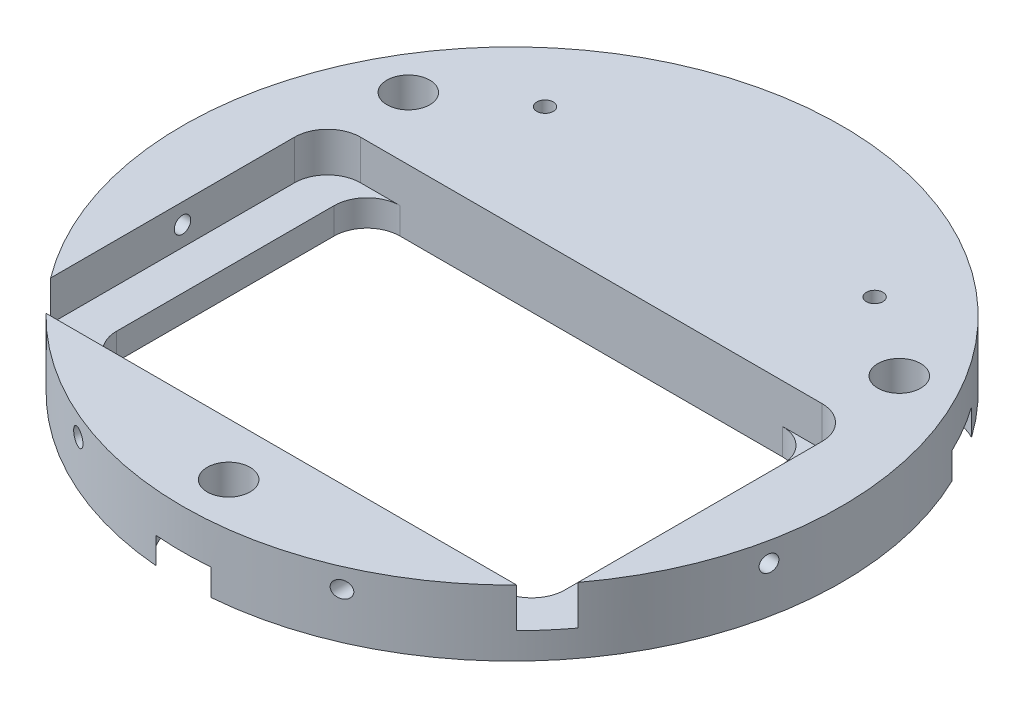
ISO-10303-21;
HEADER;
FILE_DESCRIPTION(('STEP AP214'),'2;1');
FILE_NAME('part.step','',(''),(''),'','','');
FILE_SCHEMA(('AUTOMOTIVE_DESIGN { 1 0 10303 214 1 1 1 1 }'));
ENDSEC;
DATA;
#1=APPLICATION_CONTEXT('core data for automotive mechanical design processes');
#2=APPLICATION_PROTOCOL_DEFINITION('international standard','automotive_design',2000,#1);
#3=PRODUCT_CONTEXT('',#1,'mechanical');
#4=PRODUCT('Part','Part','',(#3));
#5=PRODUCT_RELATED_PRODUCT_CATEGORY('part','',(#4));
#6=PRODUCT_DEFINITION_FORMATION('','',#4);
#7=PRODUCT_DEFINITION_CONTEXT('part definition',#1,'design');
#8=PRODUCT_DEFINITION('design','',#6,#7);
#9=PRODUCT_DEFINITION_SHAPE('','',#8);
#10=(LENGTH_UNIT() NAMED_UNIT(*) SI_UNIT(.MILLI.,.METRE.));
#11=(NAMED_UNIT(*) PLANE_ANGLE_UNIT() SI_UNIT($,.RADIAN.));
#12=(NAMED_UNIT(*) SI_UNIT($,.STERADIAN.) SOLID_ANGLE_UNIT());
#13=UNCERTAINTY_MEASURE_WITH_UNIT(LENGTH_MEASURE(1.E-05),#10,'distance_accuracy_value','');
#14=(GEOMETRIC_REPRESENTATION_CONTEXT(3) GLOBAL_UNCERTAINTY_ASSIGNED_CONTEXT((#13)) GLOBAL_UNIT_ASSIGNED_CONTEXT((#10,
#11,#12)) REPRESENTATION_CONTEXT('',''));
#15=CARTESIAN_POINT('',(0.,0.,0.));
#16=DIRECTION('',(0.,0.,1.));
#17=DIRECTION('',(1.,0.,0.));
#18=AXIS2_PLACEMENT_3D('',#15,#16,#17);
#19=CARTESIAN_POINT('',(0.,10.,43.));
#20=DIRECTION('',(0.,1.,0.));
#21=DIRECTION('',(0.,0.,1.));
#22=AXIS2_PLACEMENT_3D('',#19,#20,#21);
#23=CYLINDRICAL_SURFACE('',#22,3.25);
#24=CARTESIAN_POINT('',(0.,10.,43.));
#25=DIRECTION('',(0.,1.,0.));
#26=DIRECTION('',(0.,0.,1.));
#27=AXIS2_PLACEMENT_3D('',#24,#25,#26);
#28=CIRCLE('',#27,3.25);
#29=CARTESIAN_POINT('',(0.,10.,46.25));
#30=VERTEX_POINT('',#29);
#31=EDGE_CURVE('E206',#30,#30,#28,.F.);
#32=ORIENTED_EDGE('',*,*,#31,.F.);
#33=EDGE_LOOP('',(#32));
#34=FACE_BOUND('',#33,.T.);
#35=CARTESIAN_POINT('',(0.,4.,43.));
#36=DIRECTION('',(0.,1.,0.));
#37=DIRECTION('',(0.,0.,1.));
#38=AXIS2_PLACEMENT_3D('',#35,#36,#37);
#39=CIRCLE('',#38,3.25);
#40=CARTESIAN_POINT('',(0.,4.,46.25));
#41=VERTEX_POINT('',#40);
#42=EDGE_CURVE('E203',#41,#41,#39,.T.);
#43=ORIENTED_EDGE('',*,*,#42,.F.);
#44=EDGE_LOOP('',(#43));
#45=FACE_BOUND('',#44,.T.);
#46=ADVANCED_FACE('F17',(#34,#45),#23,.F.);
#47=CARTESIAN_POINT('',(-37.2390923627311,10.,-21.4999999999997));
#48=DIRECTION('',(0.,1.,0.));
#49=DIRECTION('',(0.,0.,1.));
#50=AXIS2_PLACEMENT_3D('',#47,#48,#49);
#51=CYLINDRICAL_SURFACE('',#50,3.25);
#52=CARTESIAN_POINT('',(-37.2390923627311,10.,-21.4999999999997));
#53=DIRECTION('',(0.,1.,0.));
#54=DIRECTION('',(0.,0.,1.));
#55=AXIS2_PLACEMENT_3D('',#52,#53,#54);
#56=CIRCLE('',#55,3.25);
#57=CARTESIAN_POINT('',(-37.2390923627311,10.,-18.2499999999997));
#58=VERTEX_POINT('',#57);
#59=EDGE_CURVE('E197',#58,#58,#56,.F.);
#60=ORIENTED_EDGE('',*,*,#59,.F.);
#61=EDGE_LOOP('',(#60));
#62=FACE_BOUND('',#61,.T.);
#63=CARTESIAN_POINT('',(-37.2390923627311,4.,-21.4999999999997));
#64=DIRECTION('',(0.,1.,0.));
#65=DIRECTION('',(0.,0.,1.));
#66=AXIS2_PLACEMENT_3D('',#63,#64,#65);
#67=CIRCLE('',#66,3.25);
#68=CARTESIAN_POINT('',(-37.2390923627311,4.,-18.2499999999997));
#69=VERTEX_POINT('',#68);
#70=EDGE_CURVE('E20',#69,#69,#67,.T.);
#71=ORIENTED_EDGE('',*,*,#70,.F.);
#72=EDGE_LOOP('',(#71));
#73=FACE_BOUND('',#72,.T.);
#74=ADVANCED_FACE('F216',(#62,#73),#51,.F.);
#75=CARTESIAN_POINT('',(37.2390923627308,10.,-21.5000000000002));
#76=DIRECTION('',(0.,1.,0.));
#77=DIRECTION('',(0.,0.,1.));
#78=AXIS2_PLACEMENT_3D('',#75,#76,#77);
#79=CYLINDRICAL_SURFACE('',#78,3.25);
#80=CARTESIAN_POINT('',(37.2390923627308,10.,-21.5000000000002));
#81=DIRECTION('',(0.,1.,0.));
#82=DIRECTION('',(0.,0.,1.));
#83=AXIS2_PLACEMENT_3D('',#80,#81,#82);
#84=CIRCLE('',#83,3.25);
#85=CARTESIAN_POINT('',(37.2390923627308,10.,-18.2500000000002));
#86=VERTEX_POINT('',#85);
#87=EDGE_CURVE('E183',#86,#86,#84,.F.);
#88=ORIENTED_EDGE('',*,*,#87,.F.);
#89=EDGE_LOOP('',(#88));
#90=FACE_BOUND('',#89,.T.);
#91=CARTESIAN_POINT('',(37.2390923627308,4.,-21.5000000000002));
#92=DIRECTION('',(0.,1.,0.));
#93=DIRECTION('',(0.,0.,1.));
#94=AXIS2_PLACEMENT_3D('',#91,#92,#93);
#95=CIRCLE('',#94,3.25);
#96=CARTESIAN_POINT('',(37.2390923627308,4.,-18.2500000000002));
#97=VERTEX_POINT('',#96);
#98=EDGE_CURVE('E200',#97,#97,#95,.T.);
#99=ORIENTED_EDGE('',*,*,#98,.F.);
#100=EDGE_LOOP('',(#99));
#101=FACE_BOUND('',#100,.T.);
#102=ADVANCED_FACE('F218',(#90,#101),#79,.F.);
#103=CARTESIAN_POINT('',(-35.,4.,-7.));
#104=DIRECTION('',(0.,1.,0.));
#105=DIRECTION('',(0.,0.,1.));
#106=AXIS2_PLACEMENT_3D('',#103,#104,#105);
#107=CYLINDRICAL_SURFACE('',#106,5.);
#108=DIRECTION('',(0.,1.,0.));
#109=VECTOR('',#108,1.);
#110=CARTESIAN_POINT('',(-40.,4.,-6.99999999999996));
#111=LINE('',#110,#109);
#112=CARTESIAN_POINT('',(-40.,10.,-6.99999999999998));
#113=VERTEX_POINT('',#112);
#114=CARTESIAN_POINT('',(-40.,4.,-6.99999999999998));
#115=VERTEX_POINT('',#114);
#116=EDGE_CURVE('E162',#113,#115,#111,.F.);
#117=ORIENTED_EDGE('',*,*,#116,.T.);
#118=CARTESIAN_POINT('',(-35.,4.,-7.));
#119=DIRECTION('',(0.,1.,0.));
#120=DIRECTION('',(0.,0.,1.));
#121=AXIS2_PLACEMENT_3D('',#118,#119,#120);
#122=CIRCLE('',#121,5.);
#123=CARTESIAN_POINT('',(-35.,4.,-12.));
#124=VERTEX_POINT('',#123);
#125=EDGE_CURVE('E686',#115,#124,#122,.F.);
#126=ORIENTED_EDGE('',*,*,#125,.T.);
#127=DIRECTION('',(0.,1.,0.));
#128=VECTOR('',#127,1.);
#129=CARTESIAN_POINT('',(-35.,0.,-12.));
#130=LINE('',#129,#128);
#131=CARTESIAN_POINT('',(-35.,10.,-12.));
#132=VERTEX_POINT('',#131);
#133=EDGE_CURVE('E188',#124,#132,#130,.T.);
#134=ORIENTED_EDGE('',*,*,#133,.T.);
#135=CARTESIAN_POINT('',(-35.,10.,-7.));
#136=DIRECTION('',(0.,1.,0.));
#137=DIRECTION('',(0.,0.,1.));
#138=AXIS2_PLACEMENT_3D('',#135,#136,#137);
#139=CIRCLE('',#138,5.);
#140=EDGE_CURVE('E178',#113,#132,#139,.F.);
#141=ORIENTED_EDGE('',*,*,#140,.F.);
#142=EDGE_LOOP('',(#117,#126,#134,#141));
#143=FACE_BOUND('',#142,.T.);
#144=ADVANCED_FACE('F186',(#143),#107,.F.);
#145=CARTESIAN_POINT('',(35.,4.,-7.));
#146=DIRECTION('',(0.,1.,0.));
#147=DIRECTION('',(0.,0.,1.));
#148=AXIS2_PLACEMENT_3D('',#145,#146,#147);
#149=CYLINDRICAL_SURFACE('',#148,5.);
#150=DIRECTION('',(0.,1.,0.));
#151=VECTOR('',#150,1.);
#152=CARTESIAN_POINT('',(35.,0.,-12.));
#153=LINE('',#152,#151);
#154=CARTESIAN_POINT('',(35.,10.,-12.));
#155=VERTEX_POINT('',#154);
#156=CARTESIAN_POINT('',(35.,4.,-12.));
#157=VERTEX_POINT('',#156);
#158=EDGE_CURVE('E714',#155,#157,#153,.F.);
#159=ORIENTED_EDGE('',*,*,#158,.T.);
#160=CARTESIAN_POINT('',(35.,4.,-7.));
#161=DIRECTION('',(0.,1.,0.));
#162=DIRECTION('',(0.,0.,1.));
#163=AXIS2_PLACEMENT_3D('',#160,#161,#162);
#164=CIRCLE('',#163,5.);
#165=CARTESIAN_POINT('',(40.,4.,-6.99999999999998));
#166=VERTEX_POINT('',#165);
#167=EDGE_CURVE('E684',#157,#166,#164,.F.);
#168=ORIENTED_EDGE('',*,*,#167,.T.);
#169=DIRECTION('',(0.,1.,0.));
#170=VECTOR('',#169,1.);
#171=CARTESIAN_POINT('',(40.,4.,-6.99999999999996));
#172=LINE('',#171,#170);
#173=CARTESIAN_POINT('',(40.,10.,-6.99999999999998));
#174=VERTEX_POINT('',#173);
#175=EDGE_CURVE('E191',#166,#174,#172,.T.);
#176=ORIENTED_EDGE('',*,*,#175,.T.);
#177=CARTESIAN_POINT('',(35.,10.,-7.));
#178=DIRECTION('',(0.,1.,0.));
#179=DIRECTION('',(0.,0.,1.));
#180=AXIS2_PLACEMENT_3D('',#177,#178,#179);
#181=CIRCLE('',#180,5.);
#182=EDGE_CURVE('E189',#155,#174,#181,.F.);
#183=ORIENTED_EDGE('',*,*,#182,.F.);
#184=EDGE_LOOP('',(#159,#168,#176,#183));
#185=FACE_BOUND('',#184,.T.);
#186=ADVANCED_FACE('F282',(#185),#149,.F.);
#187=CARTESIAN_POINT('',(-40.,4.,-6.99999999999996));
#188=DIRECTION('',(-1.,0.,0.));
#189=DIRECTION('',(0.,0.,1.));
#190=AXIS2_PLACEMENT_3D('',#187,#188,#189);
#191=PLANE('',#190);
#192=ORIENTED_EDGE('',*,*,#116,.F.);
#193=DIRECTION('',(0.,0.,1.));
#194=VECTOR('',#193,1.);
#195=CARTESIAN_POINT('',(-40.,10.,0.));
#196=LINE('',#195,#194);
#197=CARTESIAN_POINT('',(-40.,10.,30.));
#198=VERTEX_POINT('',#197);
#199=EDGE_CURVE('E167',#198,#113,#196,.F.);
#200=ORIENTED_EDGE('',*,*,#199,.F.);
#201=DIRECTION('',(0.,-1.,0.));
#202=VECTOR('',#201,1.);
#203=CARTESIAN_POINT('',(-40.,10.,30.));
#204=LINE('',#203,#202);
#205=CARTESIAN_POINT('',(-40.,4.,30.));
#206=VERTEX_POINT('',#205);
#207=EDGE_CURVE('E641',#206,#198,#204,.F.);
#208=ORIENTED_EDGE('',*,*,#207,.F.);
#209=DIRECTION('',(0.,0.,-1.));
#210=VECTOR('',#209,1.);
#211=CARTESIAN_POINT('',(-40.,4.,-7.));
#212=LINE('',#211,#210);
#213=EDGE_CURVE('E168',#206,#115,#212,.T.);
#214=ORIENTED_EDGE('',*,*,#213,.T.);
#215=EDGE_LOOP('',(#192,#200,#208,#214));
#216=FACE_BOUND('',#215,.T.);
#217=CARTESIAN_POINT('',(-40.,7.,10.));
#218=DIRECTION('',(1.,0.,0.));
#219=DIRECTION('',(0.,0.,-1.));
#220=AXIS2_PLACEMENT_3D('',#217,#218,#219);
#221=CIRCLE('',#220,1.24999999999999);
#222=CARTESIAN_POINT('',(-40.,7.,8.75000000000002));
#223=VERTEX_POINT('',#222);
#224=EDGE_CURVE('E208',#223,#223,#221,.F.);
#225=ORIENTED_EDGE('',*,*,#224,.T.);
#226=EDGE_LOOP('',(#225));
#227=FACE_BOUND('',#226,.T.);
#228=ADVANCED_FACE('F164',(#216,#227),#191,.F.);
#229=CARTESIAN_POINT('',(-37.2390923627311,4.,-21.4999999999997));
#230=DIRECTION('',(0.,-1.,0.));
#231=DIRECTION('',(0.,0.,-1.));
#232=AXIS2_PLACEMENT_3D('',#229,#230,#231);
#233=PLANE('',#232);
#234=CARTESIAN_POINT('',(0.,4.,0.));
#235=DIRECTION('',(0.,-1.,0.));
#236=DIRECTION('',(0.,0.,-1.));
#237=AXIS2_PLACEMENT_3D('',#234,#235,#236);
#238=CIRCLE('',#237,50.);
#239=CARTESIAN_POINT('',(-41.0702334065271,4.,-28.5172917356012));
#240=VERTEX_POINT('',#239);
#241=CARTESIAN_POINT('',(-45.2318157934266,4.,-21.3092196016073));
#242=VERTEX_POINT('',#241);
#243=EDGE_CURVE('E268',#240,#242,#238,.F.);
#244=ORIENTED_EDGE('',*,*,#243,.F.);
#245=CARTESIAN_POINT('',(-37.2390923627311,4.,-21.4999999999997));
#246=DIRECTION('',(0.,-1.,0.));
#247=DIRECTION('',(0.,0.,-1.));
#248=AXIS2_PLACEMENT_3D('',#245,#246,#247);
#249=CIRCLE('',#248,7.995);
#250=EDGE_CURVE('E710',#240,#242,#249,.T.);
#251=ORIENTED_EDGE('',*,*,#250,.T.);
#252=EDGE_LOOP('',(#244,#251));
#253=FACE_BOUND('',#252,.T.);
#254=ORIENTED_EDGE('',*,*,#70,.T.);
#255=EDGE_LOOP('',(#254));
#256=FACE_BOUND('',#255,.T.);
#257=ADVANCED_FACE('F214',(#253,#256),#233,.T.);
#258=CARTESIAN_POINT('',(-40.,7.,10.));
#259=DIRECTION('',(1.,0.,0.));
#260=DIRECTION('',(0.,0.,-1.));
#261=AXIS2_PLACEMENT_3D('',#258,#259,#260);
#262=CYLINDRICAL_SURFACE('',#261,1.24999999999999);
#263=ORIENTED_EDGE('',*,*,#224,.F.);
#264=EDGE_LOOP('',(#263));
#265=FACE_BOUND('',#264,.T.);
#266=CARTESIAN_POINT('',(-48.7179381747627,7.00000000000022,11.25));
#267=CARTESIAN_POINT('',(-48.7179389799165,6.93113805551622,11.2499970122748));
#268=CARTESIAN_POINT('',(-48.7192592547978,6.86218022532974,11.2442838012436));
#269=CARTESIAN_POINT('',(-48.7244916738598,6.72614598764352,11.2215882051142));
#270=CARTESIAN_POINT('',(-48.728409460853,6.65907400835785,11.2045812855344));
#271=CARTESIAN_POINT('',(-48.7386698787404,6.52889451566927,11.1598647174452));
#272=CARTESIAN_POINT('',(-48.7450090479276,6.465781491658,11.1321703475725));
#273=CARTESIAN_POINT('',(-48.7598550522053,6.34517816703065,11.0669619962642));
#274=CARTESIAN_POINT('',(-48.7683609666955,6.28768549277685,11.0294521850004));
#275=CARTESIAN_POINT('',(-48.7873342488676,6.17912820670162,10.9452225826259));
#276=CARTESIAN_POINT('',(-48.7978240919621,6.12814973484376,10.8983969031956));
#277=CARTESIAN_POINT('',(-48.8203171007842,6.03473742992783,10.79719043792));
#278=CARTESIAN_POINT('',(-48.8323205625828,5.99230527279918,10.7428081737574));
#279=CARTESIAN_POINT('',(-48.8577341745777,5.9161352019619,10.626637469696));
#280=CARTESIAN_POINT('',(-48.8711709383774,5.88262739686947,10.564703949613));
#281=CARTESIAN_POINT('',(-48.8987656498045,5.82649542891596,10.436236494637));
#282=CARTESIAN_POINT('',(-48.9129236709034,5.80387237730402,10.3697020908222));
#283=CARTESIAN_POINT('',(-48.9418000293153,5.76975449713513,10.2325563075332));
#284=CARTESIAN_POINT('',(-48.9565238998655,5.75847838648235,10.1618915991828));
#285=CARTESIAN_POINT('',(-48.9858348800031,5.74812131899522,10.0196434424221));
#286=CARTESIAN_POINT('',(-49.0004219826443,5.74904097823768,9.94805994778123));
#287=CARTESIAN_POINT('',(-49.0291341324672,5.76312766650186,9.8055758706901));
#288=CARTESIAN_POINT('',(-49.0432560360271,5.77636517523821,9.73468159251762));
#289=CARTESIAN_POINT('',(-49.0705694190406,5.81488364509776,9.59605182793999));
#290=CARTESIAN_POINT('',(-49.0837609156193,5.8401643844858,9.5283162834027));
#291=CARTESIAN_POINT('',(-49.1087743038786,5.90187840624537,9.39854366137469));
#292=CARTESIAN_POINT('',(-49.1206063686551,5.93822024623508,9.33646509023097));
#293=CARTESIAN_POINT('',(-49.1427351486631,6.02115957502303,9.21928102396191));
#294=CARTESIAN_POINT('',(-49.153032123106,6.06775532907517,9.16417435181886));
#295=CARTESIAN_POINT('',(-49.1716983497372,6.16906806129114,9.06347985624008));
#296=CARTESIAN_POINT('',(-49.1800964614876,6.22363923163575,9.017750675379));
#297=CARTESIAN_POINT('',(-49.1949986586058,6.33995475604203,8.93609738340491));
#298=CARTESIAN_POINT('',(-49.2015020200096,6.40170183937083,8.90017702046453));
#299=CARTESIAN_POINT('',(-49.2123855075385,6.52951763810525,8.83979879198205));
#300=CARTESIAN_POINT('',(-49.2167976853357,6.59550223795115,8.81516809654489));
#301=CARTESIAN_POINT('',(-49.223555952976,6.73067118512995,8.77735234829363));
#302=CARTESIAN_POINT('',(-49.2259066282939,6.79984806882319,8.76414189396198));
#303=CARTESIAN_POINT('',(-49.227612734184,6.89122813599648,8.75455003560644));
#304=CARTESIAN_POINT('',(-49.2279159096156,6.91294385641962,8.75284505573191));
#305=CARTESIAN_POINT('',(-49.2283204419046,6.95643662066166,8.7505695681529));
#306=CARTESIAN_POINT('',(-49.2284217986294,6.97821366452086,8.74999906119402));
#307=CARTESIAN_POINT('',(-49.2284212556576,7.06931994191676,8.75000298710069));
#308=CARTESIAN_POINT('',(-49.2273934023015,7.13873395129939,8.75579123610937));
#309=CARTESIAN_POINT('',(-49.2232960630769,7.27568028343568,8.77879583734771));
#310=CARTESIAN_POINT('',(-49.2202222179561,7.34320826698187,8.79603659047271));
#311=CARTESIAN_POINT('',(-49.2120927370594,7.47430097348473,8.84140575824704));
#312=CARTESIAN_POINT('',(-49.2070393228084,7.53787004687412,8.86952196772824));
#313=CARTESIAN_POINT('',(-49.1950521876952,7.65931509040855,8.93576899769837));
#314=CARTESIAN_POINT('',(-49.1881193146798,7.71719361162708,8.9738953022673));
#315=CARTESIAN_POINT('',(-49.1724616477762,7.82607476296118,9.05929944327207));
#316=CARTESIAN_POINT('',(-49.1637257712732,7.8770314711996,9.106633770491));
#317=CARTESIAN_POINT('',(-49.1446717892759,7.97028852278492,9.20890523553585));
#318=CARTESIAN_POINT('',(-49.1343534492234,8.01258758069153,9.26384350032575));
#319=CARTESIAN_POINT('',(-49.1121960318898,8.08800405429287,9.38060649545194));
#320=CARTESIAN_POINT('',(-49.1003367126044,8.12097635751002,9.44252109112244));
#321=CARTESIAN_POINT('',(-49.0754954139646,8.17607487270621,9.57078967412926));
#322=CARTESIAN_POINT('',(-49.0625133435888,8.1982002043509,9.63714402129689));
#323=CARTESIAN_POINT('',(-49.0355115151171,8.23136664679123,9.77361382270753));
#324=CARTESIAN_POINT('',(-49.0214778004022,8.2422115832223,9.8437742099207));
#325=CARTESIAN_POINT('',(-48.9929426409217,8.25190591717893,9.9848259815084));
#326=CARTESIAN_POINT('',(-48.9784411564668,8.25075429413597,10.0557174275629));
#327=CARTESIAN_POINT('',(-48.9491860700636,8.23642162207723,10.1971793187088));
#328=CARTESIAN_POINT('',(-48.9344316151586,8.22308696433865,10.2677340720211));
#329=CARTESIAN_POINT('',(-48.90530017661,8.1845294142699,10.4056034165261));
#330=CARTESIAN_POINT('',(-48.8909232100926,8.159305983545,10.4729178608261));
#331=CARTESIAN_POINT('',(-48.8629921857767,8.0975808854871,10.6024712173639));
#332=CARTESIAN_POINT('',(-48.8494392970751,8.0610636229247,10.6647029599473));
#333=CARTESIAN_POINT('',(-48.8236529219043,7.97772193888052,10.7821396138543));
#334=CARTESIAN_POINT('',(-48.8114192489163,7.93089897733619,10.8373455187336));
#335=CARTESIAN_POINT('',(-48.7888860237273,7.82891564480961,10.93833842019));
#336=CARTESIAN_POINT('',(-48.7785623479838,7.77387781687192,10.9842437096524));
#337=CARTESIAN_POINT('',(-48.7600502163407,7.65649289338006,11.0661317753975));
#338=CARTESIAN_POINT('',(-48.7518625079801,7.59414324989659,11.1021110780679));
#339=CARTESIAN_POINT('',(-48.7381315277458,7.46545272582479,11.1622340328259));
#340=CARTESIAN_POINT('',(-48.7325327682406,7.39923360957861,11.186626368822));
#341=CARTESIAN_POINT('',(-48.7239595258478,7.2635769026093,11.2239093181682));
#342=CARTESIAN_POINT('',(-48.7209789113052,7.19414723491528,11.2368268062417));
#343=CARTESIAN_POINT('',(-48.7188903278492,7.10356376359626,11.2458759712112));
#344=CARTESIAN_POINT('',(-48.7185335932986,7.08288519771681,11.2474212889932));
#345=CARTESIAN_POINT('',(-48.7180573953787,7.04147398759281,11.2494837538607));
#346=CARTESIAN_POINT('',(-48.7179379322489,7.0207413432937,11.2500008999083));
#347=CARTESIAN_POINT('',(-48.7179381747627,7.00000000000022,11.25));
#348=B_SPLINE_CURVE_WITH_KNOTS('',3,(#266,#267,#268,#269,#270,#271,#272,#273,#274,#275,#276,
#277,#278,#279,#280,#281,#282,#283,#284,#285,#286,#287,#288,#289,#290,#291,#292,#293,#294,#295,
#296,#297,#298,#299,#300,#301,#302,#303,#304,#305,#306,#307,#308,#309,#310,#311,#312,#313,#314,
#315,#316,#317,#318,#319,#320,#321,#322,#323,#324,#325,#326,#327,#328,#329,#330,#331,#332,#333,
#334,#335,#336,#337,#338,#339,#340,#341,#342,#343,#344,#345,#346,#347),.UNSPECIFIED.,.T.,.F.,(4,
2,2,2,2,2,2,2,2,2,2,2,2,2,2,2,2,2,2,2,2,2,2,2,2,2,2,2,2,2,2,2,2,2,2,2,2,2,2,2,4),(0.,
0.206505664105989,0.413461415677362,0.62012239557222,0.826695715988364,1.03576706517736,
1.24487937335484,1.45895196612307,1.67304640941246,1.89119283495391,2.10935028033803,
2.32876369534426,2.54817307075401,2.76581570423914,2.98342154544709,3.19745668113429,
3.41157349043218,3.62229295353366,3.83254250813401,3.89787525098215,3.9632080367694,
4.17108443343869,4.37940516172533,4.58749277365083,4.79548667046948,5.00479931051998,
5.2141430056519,5.42658416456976,5.63904256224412,5.85513695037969,6.07124972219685,
6.290125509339,6.50901120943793,6.72820052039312,6.94735880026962,7.16352526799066,
7.37976728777,7.59113123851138,7.80199884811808,7.86419866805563,7.92639855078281),.UNSPECIFIED.);
#349=CARTESIAN_POINT('',(-48.7179381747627,7.00000000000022,11.25));
#350=VERTEX_POINT('',#349);
#351=EDGE_CURVE('E261',#350,#350,#348,.T.);
#352=ORIENTED_EDGE('',*,*,#351,.F.);
#353=EDGE_LOOP('',(#352));
#354=FACE_BOUND('',#353,.T.);
#355=ADVANCED_FACE('F270',(#265,#354),#262,.F.);
#356=CARTESIAN_POINT('',(-20.,7.,31.));
#357=DIRECTION('',(0.,0.,-1.));
#358=DIRECTION('',(-1.,0.,0.));
#359=AXIS2_PLACEMENT_3D('',#356,#357,#358);
#360=CYLINDRICAL_SURFACE('',#359,1.24999999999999);
#361=CARTESIAN_POINT('',(-20.,7.,35.));
#362=DIRECTION('',(0.,0.,-1.));
#363=DIRECTION('',(-1.,0.,0.));
#364=AXIS2_PLACEMENT_3D('',#361,#362,#363);
#365=CIRCLE('',#364,1.24999999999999);
#366=CARTESIAN_POINT('',(-21.25,7.,35.));
#367=VERTEX_POINT('',#366);
#368=EDGE_CURVE('E683',#367,#367,#365,.T.);
#369=ORIENTED_EDGE('',*,*,#368,.T.);
#370=EDGE_LOOP('',(#369));
#371=FACE_BOUND('',#370,.T.);
#372=CARTESIAN_POINT('',(-18.75,7.00000000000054,46.3512405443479));
#373=CARTESIAN_POINT('',(-18.7500030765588,6.93368606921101,46.3512394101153));
#374=CARTESIAN_POINT('',(-18.7553054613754,6.86727575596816,46.3490954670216));
#375=CARTESIAN_POINT('',(-18.7763236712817,6.73630865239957,46.3405847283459));
#376=CARTESIAN_POINT('',(-18.7920627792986,6.67175634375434,46.3342084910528));
#377=CARTESIAN_POINT('',(-18.8332866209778,6.54655665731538,46.3174676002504));
#378=CARTESIAN_POINT('',(-18.8587489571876,6.48590067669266,46.3071121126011));
#379=CARTESIAN_POINT('',(-18.9184457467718,6.3699242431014,46.2827553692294));
#380=CARTESIAN_POINT('',(-18.9526769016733,6.31460179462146,46.2687554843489));
#381=CARTESIAN_POINT('',(-19.0298466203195,6.20898629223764,46.2370708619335));
#382=CARTESIAN_POINT('',(-19.0730090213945,6.1588857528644,46.2192909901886));
#383=CARTESIAN_POINT('',(-19.1659860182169,6.06661106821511,46.1808132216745));
#384=CARTESIAN_POINT('',(-19.2158028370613,6.02443958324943,46.1601143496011));
#385=CARTESIAN_POINT('',(-19.32429662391,5.94609981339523,46.1148050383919));
#386=CARTESIAN_POINT('',(-19.3833483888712,5.91055028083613,46.090022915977));
#387=CARTESIAN_POINT('',(-19.5057188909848,5.84984517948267,46.0383681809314));
#388=CARTESIAN_POINT('',(-19.5690390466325,5.82469308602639,46.0114948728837));
#389=CARTESIAN_POINT('',(-19.7031803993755,5.78357931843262,45.9542205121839));
#390=CARTESIAN_POINT('',(-19.7742080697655,5.76844794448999,45.9237060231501));
#391=CARTESIAN_POINT('',(-19.9174260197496,5.75064285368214,45.861773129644));
#392=CARTESIAN_POINT('',(-19.9896166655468,5.7479731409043,45.8303544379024));
#393=CARTESIAN_POINT('',(-20.1372007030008,5.75524252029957,45.7657074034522));
#394=CARTESIAN_POINT('',(-20.2125584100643,5.76586497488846,45.7324723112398));
#395=CARTESIAN_POINT('',(-20.3604615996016,5.8006913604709,45.6668167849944));
#396=CARTESIAN_POINT('',(-20.4330065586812,5.82489780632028,45.6343965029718));
#397=CARTESIAN_POINT('',(-20.5734981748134,5.8866642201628,45.5712314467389));
#398=CARTESIAN_POINT('',(-20.6414200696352,5.92429024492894,45.5404958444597));
#399=CARTESIAN_POINT('',(-20.7699724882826,6.01222458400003,45.4820099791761));
#400=CARTESIAN_POINT('',(-20.8306054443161,6.06252865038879,45.4542587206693));
#401=CARTESIAN_POINT('',(-20.9390387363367,6.17157806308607,45.4044053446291));
#402=CARTESIAN_POINT('',(-20.9873690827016,6.22968937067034,45.3820732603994));
#403=CARTESIAN_POINT('',(-21.0733330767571,6.35485783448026,45.3422197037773));
#404=CARTESIAN_POINT('',(-21.1109688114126,6.42191324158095,45.3246972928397));
#405=CARTESIAN_POINT('',(-21.1706518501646,6.55619726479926,45.2968485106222));
#406=CARTESIAN_POINT('',(-21.1938333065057,6.6228150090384,45.285999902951));
#407=CARTESIAN_POINT('',(-21.2286573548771,6.7594964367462,45.2696862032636));
#408=CARTESIAN_POINT('',(-21.240334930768,6.82954898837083,45.2642047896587));
#409=CARTESIAN_POINT('',(-21.2486691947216,6.93331195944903,45.2602922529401));
#410=CARTESIAN_POINT('',(-21.2500039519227,6.96664543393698,45.2596655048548));
#411=CARTESIAN_POINT('',(-21.2499922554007,7.06536508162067,45.259671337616));
#412=CARTESIAN_POINT('',(-21.2448432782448,7.13081116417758,45.2620897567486));
#413=CARTESIAN_POINT('',(-21.2244435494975,7.25985830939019,45.2716590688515));
#414=CARTESIAN_POINT('',(-21.2091690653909,7.32345467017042,45.2788210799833));
#415=CARTESIAN_POINT('',(-21.1692361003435,7.44673291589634,45.2975046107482));
#416=CARTESIAN_POINT('',(-21.1446052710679,7.50642573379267,45.3090132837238));
#417=CARTESIAN_POINT('',(-21.0869415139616,7.6206052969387,45.3358787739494));
#418=CARTESIAN_POINT('',(-21.0539114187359,7.67509378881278,45.3512342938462));
#419=CARTESIAN_POINT('',(-20.9791062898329,7.77984449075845,45.3858883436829));
#420=CARTESIAN_POINT('',(-20.9370332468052,7.82984897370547,45.4053204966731));
#421=CARTESIAN_POINT('',(-20.8463576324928,7.92215472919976,45.447022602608));
#422=CARTESIAN_POINT('',(-20.7977524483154,7.96445290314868,45.469293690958));
#423=CARTESIAN_POINT('',(-20.6907389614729,8.04413510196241,45.5180961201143));
#424=CARTESIAN_POINT('',(-20.6318425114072,8.08073926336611,45.5448303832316));
#425=CARTESIAN_POINT('',(-20.5094960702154,8.14352381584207,45.6000557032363));
#426=CARTESIAN_POINT('',(-20.4460443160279,8.16970014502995,45.6285474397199));
#427=CARTESIAN_POINT('',(-20.3108075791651,8.2129886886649,45.68891560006));
#428=CARTESIAN_POINT('',(-20.2387658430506,8.22918214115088,45.7208780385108));
#429=CARTESIAN_POINT('',(-20.0930750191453,8.24869631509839,45.7850923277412));
#430=CARTESIAN_POINT('',(-20.0194254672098,8.25201326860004,45.8173442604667));
#431=CARTESIAN_POINT('',(-19.8694255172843,8.24551645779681,45.8825989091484));
#432=CARTESIAN_POINT('',(-19.79308756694,8.23516126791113,45.9155785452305));
#433=CARTESIAN_POINT('',(-19.6429790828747,8.20040420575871,45.9799961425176));
#434=CARTESIAN_POINT('',(-19.5692086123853,8.17600198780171,46.0114340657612));
#435=CARTESIAN_POINT('',(-19.4278504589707,8.1140004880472,46.0712971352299));
#436=CARTESIAN_POINT('',(-19.3601776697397,8.0766376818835,46.0997651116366));
#437=CARTESIAN_POINT('',(-19.2320225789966,7.98930032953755,46.1533761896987));
#438=CARTESIAN_POINT('',(-19.1715369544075,7.93933164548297,46.1785208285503));
#439=CARTESIAN_POINT('',(-19.0638741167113,7.83161502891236,46.2230665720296));
#440=CARTESIAN_POINT('',(-19.0160847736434,7.77459082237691,46.2427359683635));
#441=CARTESIAN_POINT('',(-18.930907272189,7.65199893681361,46.2776714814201));
#442=CARTESIAN_POINT('',(-18.893518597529,7.5864316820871,46.2929378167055));
#443=CARTESIAN_POINT('',(-18.8334007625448,7.45430794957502,46.3174264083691));
#444=CARTESIAN_POINT('',(-18.8097438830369,7.38824267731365,46.3270320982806));
#445=CARTESIAN_POINT('',(-18.7738165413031,7.25270965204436,46.3416032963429));
#446=CARTESIAN_POINT('',(-18.7615150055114,7.18325173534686,46.3465814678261));
#447=CARTESIAN_POINT('',(-18.753429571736,7.09445732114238,46.3498530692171));
#448=CARTESIAN_POINT('',(-18.7521446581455,7.07559474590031,46.3503729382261));
#449=CARTESIAN_POINT('',(-18.7504294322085,7.03782406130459,46.3510668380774));
#450=CARTESIAN_POINT('',(-18.7499991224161,7.01891595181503,46.3512408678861));
#451=CARTESIAN_POINT('',(-18.75,7.00000000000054,46.3512405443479));
#452=B_SPLINE_CURVE_WITH_KNOTS('',3,(#372,#373,#374,#375,#376,#377,#378,#379,#380,#381,#382,
#383,#384,#385,#386,#387,#388,#389,#390,#391,#392,#393,#394,#395,#396,#397,#398,#399,#400,#401,
#402,#403,#404,#405,#406,#407,#408,#409,#410,#411,#412,#413,#414,#415,#416,#417,#418,#419,#420,
#421,#422,#423,#424,#425,#426,#427,#428,#429,#430,#431,#432,#433,#434,#435,#436,#437,#438,#439,
#440,#441,#442,#443,#444,#445,#446,#447,#448,#449,#450,#451),.UNSPECIFIED.,.T.,.F.,(4,2,2,2,2,2,
2,2,2,2,2,2,2,2,2,2,2,2,2,2,2,2,2,2,2,2,2,2,2,2,2,2,2,2,2,2,2,2,2,4),(0.,0.198866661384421,
0.398178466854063,0.597033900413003,0.795814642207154,1.00036330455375,1.20498047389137,
1.42378110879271,1.64265481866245,1.87793625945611,2.113293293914,2.36126291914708,
2.60927846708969,2.85853209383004,3.10770231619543,3.34285580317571,3.57796337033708,
3.7909324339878,4.00325183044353,4.1032635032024,4.29925679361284,4.49571109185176,
4.69158925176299,4.88740144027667,5.09108015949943,5.29484059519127,5.51685762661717,
5.73896105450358,5.97926856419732,6.21964638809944,6.46983469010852,6.72002914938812,
6.96587986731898,7.21161646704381,7.44126062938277,7.67089339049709,7.8823073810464,
8.09314111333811,8.14986736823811,8.20659379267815),.UNSPECIFIED.);
#453=CARTESIAN_POINT('',(-18.75,7.00000000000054,46.3512405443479));
#454=VERTEX_POINT('',#453);
#455=EDGE_CURVE('E256',#454,#454,#452,.T.);
#456=ORIENTED_EDGE('',*,*,#455,.F.);
#457=EDGE_LOOP('',(#456));
#458=FACE_BOUND('',#457,.T.);
#459=ADVANCED_FACE('F274',(#371,#458),#360,.F.);
#460=CARTESIAN_POINT('',(20.,7.,31.));
#461=DIRECTION('',(0.,0.,-1.));
#462=DIRECTION('',(-1.,0.,0.));
#463=AXIS2_PLACEMENT_3D('',#460,#461,#462);
#464=CYLINDRICAL_SURFACE('',#463,1.24999999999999);
#465=CARTESIAN_POINT('',(20.,7.,35.));
#466=DIRECTION('',(0.,0.,-1.));
#467=DIRECTION('',(-1.,0.,0.));
#468=AXIS2_PLACEMENT_3D('',#465,#466,#467);
#469=CIRCLE('',#468,1.24999999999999);
#470=CARTESIAN_POINT('',(18.75,7.,35.));
#471=VERTEX_POINT('',#470);
#472=EDGE_CURVE('E695',#471,#471,#469,.T.);
#473=ORIENTED_EDGE('',*,*,#472,.T.);
#474=EDGE_LOOP('',(#473));
#475=FACE_BOUND('',#474,.T.);
#476=CARTESIAN_POINT('',(21.25,6.99999999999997,45.2596674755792));
#477=CARTESIAN_POINT('',(21.2499922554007,6.9346349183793,45.259671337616));
#478=CARTESIAN_POINT('',(21.2448432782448,6.86918883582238,45.2620897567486));
#479=CARTESIAN_POINT('',(21.2244435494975,6.74014169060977,45.2716590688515));
#480=CARTESIAN_POINT('',(21.2091690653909,6.67654532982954,45.2788210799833));
#481=CARTESIAN_POINT('',(21.1692361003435,6.55326708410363,45.2975046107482));
#482=CARTESIAN_POINT('',(21.1446052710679,6.4935742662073,45.3090132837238));
#483=CARTESIAN_POINT('',(21.0869415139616,6.37939470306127,45.3358787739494));
#484=CARTESIAN_POINT('',(21.0539114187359,6.32490621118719,45.3512342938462));
#485=CARTESIAN_POINT('',(20.9791062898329,6.22015550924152,45.3858883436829));
#486=CARTESIAN_POINT('',(20.9370332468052,6.1701510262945,45.4053204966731));
#487=CARTESIAN_POINT('',(20.8463576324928,6.07784527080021,45.447022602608));
#488=CARTESIAN_POINT('',(20.7977524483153,6.03554709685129,45.469293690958));
#489=CARTESIAN_POINT('',(20.6907389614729,5.95586489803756,45.5180961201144));
#490=CARTESIAN_POINT('',(20.6318425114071,5.91926073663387,45.5448303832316));
#491=CARTESIAN_POINT('',(20.5094960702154,5.85647618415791,45.6000557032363));
#492=CARTESIAN_POINT('',(20.4460443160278,5.83029985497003,45.6285474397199));
#493=CARTESIAN_POINT('',(20.3108075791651,5.78701131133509,45.68891560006));
#494=CARTESIAN_POINT('',(20.2387658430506,5.77081785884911,45.7208780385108));
#495=CARTESIAN_POINT('',(20.0930750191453,5.7513036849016,45.7850923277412));
#496=CARTESIAN_POINT('',(20.0194254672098,5.74798673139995,45.8173442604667));
#497=CARTESIAN_POINT('',(19.8694255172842,5.75448354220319,45.8825989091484));
#498=CARTESIAN_POINT('',(19.79308756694,5.76483873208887,45.9155785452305));
#499=CARTESIAN_POINT('',(19.6429790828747,5.7995957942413,45.9799961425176));
#500=CARTESIAN_POINT('',(19.5692086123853,5.8239980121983,46.0114340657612));
#501=CARTESIAN_POINT('',(19.4278504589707,5.88599951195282,46.0712971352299));
#502=CARTESIAN_POINT('',(19.3601776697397,5.92336231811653,46.0997651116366));
#503=CARTESIAN_POINT('',(19.2320225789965,6.01069967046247,46.1533761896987));
#504=CARTESIAN_POINT('',(19.1715369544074,6.06066835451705,46.1785208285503));
#505=CARTESIAN_POINT('',(19.0638741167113,6.16838497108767,46.2230665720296));
#506=CARTESIAN_POINT('',(19.0160847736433,6.22540917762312,46.2427359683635));
#507=CARTESIAN_POINT('',(18.930907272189,6.34800106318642,46.2776714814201));
#508=CARTESIAN_POINT('',(18.893518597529,6.41356831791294,46.2929378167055));
#509=CARTESIAN_POINT('',(18.8334007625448,6.54569205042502,46.3174264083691));
#510=CARTESIAN_POINT('',(18.8097438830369,6.61175732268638,46.3270320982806));
#511=CARTESIAN_POINT('',(18.773816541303,6.74729034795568,46.3416032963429));
#512=CARTESIAN_POINT('',(18.7615150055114,6.81674826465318,46.3465814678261));
#513=CARTESIAN_POINT('',(18.753429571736,6.90554267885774,46.3498530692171));
#514=CARTESIAN_POINT('',(18.7521446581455,6.9244052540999,46.3503729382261));
#515=CARTESIAN_POINT('',(18.7504294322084,6.96217593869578,46.3510668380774));
#516=CARTESIAN_POINT('',(18.7499991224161,6.98108404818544,46.3512408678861));
#517=CARTESIAN_POINT('',(18.7500030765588,7.06631393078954,46.3512394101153));
#518=CARTESIAN_POINT('',(18.7553054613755,7.13272424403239,46.3490954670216));
#519=CARTESIAN_POINT('',(18.7763236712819,7.26369134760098,46.3405847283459));
#520=CARTESIAN_POINT('',(18.7920627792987,7.3282436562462,46.3342084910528));
#521=CARTESIAN_POINT('',(18.8332866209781,7.45344334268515,46.3174676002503));
#522=CARTESIAN_POINT('',(18.8587489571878,7.51409932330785,46.307112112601));
#523=CARTESIAN_POINT('',(18.918445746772,7.63007575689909,46.2827553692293));
#524=CARTESIAN_POINT('',(18.9526769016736,7.68539820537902,46.2687554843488));
#525=CARTESIAN_POINT('',(19.0298466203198,7.7910137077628,46.2370708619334));
#526=CARTESIAN_POINT('',(19.0730090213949,7.84111424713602,46.2192909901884));
#527=CARTESIAN_POINT('',(19.1659860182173,7.93338893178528,46.1808132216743));
#528=CARTESIAN_POINT('',(19.2158028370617,7.97556041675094,46.1601143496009));
#529=CARTESIAN_POINT('',(19.3242966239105,8.05390018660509,46.1148050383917));
#530=CARTESIAN_POINT('',(19.3833483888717,8.08944971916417,46.0900229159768));
#531=CARTESIAN_POINT('',(19.5057188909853,8.15015482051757,46.0383681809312));
#532=CARTESIAN_POINT('',(19.5690390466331,8.17530691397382,46.0114948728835));
#533=CARTESIAN_POINT('',(19.7031803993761,8.21642068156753,45.9542205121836));
#534=CARTESIAN_POINT('',(19.7742080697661,8.23155205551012,45.9237060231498));
#535=CARTESIAN_POINT('',(19.9174260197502,8.24935714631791,45.8617731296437));
#536=CARTESIAN_POINT('',(19.9896166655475,8.2520268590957,45.8303544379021));
#537=CARTESIAN_POINT('',(20.1372007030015,8.24475747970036,45.7657074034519));
#538=CARTESIAN_POINT('',(20.2125584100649,8.23413502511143,45.7324723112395));
#539=CARTESIAN_POINT('',(20.3604615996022,8.1993086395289,45.6668167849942));
#540=CARTESIAN_POINT('',(20.4330065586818,8.17510219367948,45.6343965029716));
#541=CARTESIAN_POINT('',(20.573498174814,8.11333577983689,45.5712314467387));
#542=CARTESIAN_POINT('',(20.6414200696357,8.07570975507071,45.5404958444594));
#543=CARTESIAN_POINT('',(20.7699724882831,7.98777541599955,45.4820099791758));
#544=CARTESIAN_POINT('',(20.8306054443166,7.93747134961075,45.4542587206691));
#545=CARTESIAN_POINT('',(20.9390387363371,7.82842193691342,45.4044053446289));
#546=CARTESIAN_POINT('',(20.987369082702,7.77031062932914,45.3820732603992));
#547=CARTESIAN_POINT('',(21.0733330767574,7.64514216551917,45.3422197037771));
#548=CARTESIAN_POINT('',(21.1109688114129,7.57808675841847,45.3246972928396));
#549=CARTESIAN_POINT('',(21.1706518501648,7.44380273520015,45.2968485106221));
#550=CARTESIAN_POINT('',(21.1938333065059,7.377184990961,45.2859999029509));
#551=CARTESIAN_POINT('',(21.2286573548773,7.2405035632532,45.2696862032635));
#552=CARTESIAN_POINT('',(21.2403349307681,7.17045101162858,45.2642047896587));
#553=CARTESIAN_POINT('',(21.2486691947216,7.06668804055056,45.2602922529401));
#554=CARTESIAN_POINT('',(21.2500039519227,7.03335456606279,45.2596655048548));
#555=CARTESIAN_POINT('',(21.25,6.99999999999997,45.2596674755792));
#556=B_SPLINE_CURVE_WITH_KNOTS('',3,(#476,#477,#478,#479,#480,#481,#482,#483,#484,#485,#486,
#487,#488,#489,#490,#491,#492,#493,#494,#495,#496,#497,#498,#499,#500,#501,#502,#503,#504,#505,
#506,#507,#508,#509,#510,#511,#512,#513,#514,#515,#516,#517,#518,#519,#520,#521,#522,#523,#524,
#525,#526,#527,#528,#529,#530,#531,#532,#533,#534,#535,#536,#537,#538,#539,#540,#541,#542,#543,
#544,#545,#546,#547,#548,#549,#550,#551,#552,#553,#554,#555),.UNSPECIFIED.,.T.,.F.,(4,2,2,2,2,2,
2,2,2,2,2,2,2,2,2,2,2,2,2,2,2,2,2,2,2,2,2,2,2,2,2,2,2,2,2,2,2,2,2,4),(0.,0.195993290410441,
0.392447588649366,0.588325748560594,0.78413793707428,0.98781665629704,1.19157709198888,
1.41359412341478,1.63569755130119,1.87600506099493,2.11638288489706,2.36657118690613,
2.61676564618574,2.86261636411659,3.10835296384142,3.33799712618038,3.5676298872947,
3.77904387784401,3.98987761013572,4.04660386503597,4.10333028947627,4.3021969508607,
4.50150875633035,4.7003641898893,4.89914493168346,5.10369359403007,5.30831076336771,
5.52711139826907,5.74598510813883,5.98126654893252,6.21662358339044,6.46459320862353,
6.71260875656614,6.96186238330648,7.21103260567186,7.44618609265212,7.68129365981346,
7.89426272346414,8.10658211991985,8.20659379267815),.UNSPECIFIED.);
#557=CARTESIAN_POINT('',(21.25,6.99999999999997,45.2596674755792));
#558=VERTEX_POINT('',#557);
#559=EDGE_CURVE('E248',#558,#558,#556,.T.);
#560=ORIENTED_EDGE('',*,*,#559,.F.);
#561=EDGE_LOOP('',(#560));
#562=FACE_BOUND('',#561,.T.);
#563=ADVANCED_FACE('F315',(#475,#562),#464,.F.);
#564=CARTESIAN_POINT('',(40.,7.,9.99999999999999));
#565=DIRECTION('',(-1.,0.,0.));
#566=DIRECTION('',(0.,0.,1.));
#567=AXIS2_PLACEMENT_3D('',#564,#565,#566);
#568=CYLINDRICAL_SURFACE('',#567,1.24999999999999);
#569=CARTESIAN_POINT('',(40.,7.,9.99999999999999));
#570=DIRECTION('',(-1.,0.,0.));
#571=DIRECTION('',(0.,0.,1.));
#572=AXIS2_PLACEMENT_3D('',#569,#570,#571);
#573=CIRCLE('',#572,1.24999999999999);
#574=CARTESIAN_POINT('',(40.,7.,11.25));
#575=VERTEX_POINT('',#574);
#576=EDGE_CURVE('E687',#575,#575,#573,.T.);
#577=ORIENTED_EDGE('',*,*,#576,.T.);
#578=EDGE_LOOP('',(#577));
#579=FACE_BOUND('',#578,.T.);
#580=CARTESIAN_POINT('',(49.228421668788,7.000000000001,8.75));
#581=CARTESIAN_POINT('',(49.2284212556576,6.93068005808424,8.75000298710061));
#582=CARTESIAN_POINT('',(49.2273934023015,6.86126604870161,8.75579123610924));
#583=CARTESIAN_POINT('',(49.2232960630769,6.72431971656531,8.77879583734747));
#584=CARTESIAN_POINT('',(49.2202222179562,6.6567917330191,8.79603659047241));
#585=CARTESIAN_POINT('',(49.2120927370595,6.5256990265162,8.84140575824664));
#586=CARTESIAN_POINT('',(49.2070393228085,6.46212995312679,8.86952196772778));
#587=CARTESIAN_POINT('',(49.1950521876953,6.34068490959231,8.93576899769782));
#588=CARTESIAN_POINT('',(49.1881193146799,6.28280638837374,8.9738953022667));
#589=CARTESIAN_POINT('',(49.1724616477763,6.17392523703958,9.05929944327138));
#590=CARTESIAN_POINT('',(49.1637257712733,6.12296852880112,9.10663377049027));
#591=CARTESIAN_POINT('',(49.1446717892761,6.02971147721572,9.20890523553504));
#592=CARTESIAN_POINT('',(49.1343534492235,5.98741241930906,9.26384350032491));
#593=CARTESIAN_POINT('',(49.11219603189,5.91199594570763,9.38060649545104));
#594=CARTESIAN_POINT('',(49.1003367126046,5.87902364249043,9.44252109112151));
#595=CARTESIAN_POINT('',(49.0754954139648,5.82392512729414,9.57078967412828));
#596=CARTESIAN_POINT('',(49.062513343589,5.8017997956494,9.63714402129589));
#597=CARTESIAN_POINT('',(49.0355115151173,5.76863335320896,9.77361382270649));
#598=CARTESIAN_POINT('',(49.0214778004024,5.75778841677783,9.84377420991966));
#599=CARTESIAN_POINT('',(48.992942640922,5.74809408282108,9.98482598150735));
#600=CARTESIAN_POINT('',(48.978441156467,5.74924570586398,10.0557174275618));
#601=CARTESIAN_POINT('',(48.9491860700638,5.76357837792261,10.1971793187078));
#602=CARTESIAN_POINT('',(48.9344316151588,5.77691303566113,10.2677340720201));
#603=CARTESIAN_POINT('',(48.9053001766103,5.81547058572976,10.4056034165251));
#604=CARTESIAN_POINT('',(48.8909232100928,5.8406940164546,10.4729178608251));
#605=CARTESIAN_POINT('',(48.8629921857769,5.90241911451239,10.6024712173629));
#606=CARTESIAN_POINT('',(48.8494392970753,5.93893637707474,10.6647029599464));
#607=CARTESIAN_POINT('',(48.8236529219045,6.02227806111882,10.7821396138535));
#608=CARTESIAN_POINT('',(48.8114192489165,6.06910102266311,10.8373455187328));
#609=CARTESIAN_POINT('',(48.7888860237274,6.17108435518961,10.9383384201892));
#610=CARTESIAN_POINT('',(48.7785623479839,6.22612218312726,10.9842437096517));
#611=CARTESIAN_POINT('',(48.7600502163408,6.34350710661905,11.0661317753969));
#612=CARTESIAN_POINT('',(48.7518625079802,6.4058567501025,11.1021110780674));
#613=CARTESIAN_POINT('',(48.7381315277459,6.53454727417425,11.1622340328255));
#614=CARTESIAN_POINT('',(48.7325327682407,6.60076639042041,11.1866263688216));
#615=CARTESIAN_POINT('',(48.7239595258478,6.7364230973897,11.223909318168));
#616=CARTESIAN_POINT('',(48.7209789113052,6.80585276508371,11.2368268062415));
#617=CARTESIAN_POINT('',(48.7188903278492,6.89643623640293,11.2458759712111));
#618=CARTESIAN_POINT('',(48.7185335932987,6.91711480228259,11.2474212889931));
#619=CARTESIAN_POINT('',(48.7180573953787,6.958526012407,11.2494837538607));
#620=CARTESIAN_POINT('',(48.7179379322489,6.97925865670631,11.2500008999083));
#621=CARTESIAN_POINT('',(48.7179389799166,7.06886194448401,11.2499970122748));
#622=CARTESIAN_POINT('',(48.7192592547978,7.13781977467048,11.2442838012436));
#623=CARTESIAN_POINT('',(48.7244916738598,7.2738540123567,11.2215882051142));
#624=CARTESIAN_POINT('',(48.728409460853,7.34092599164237,11.2045812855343));
#625=CARTESIAN_POINT('',(48.7386698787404,7.47110548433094,11.1598647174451));
#626=CARTESIAN_POINT('',(48.7450090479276,7.5342185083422,11.1321703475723));
#627=CARTESIAN_POINT('',(48.7598550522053,7.65482183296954,11.0669619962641));
#628=CARTESIAN_POINT('',(48.7683609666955,7.71231450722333,11.0294521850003));
#629=CARTESIAN_POINT('',(48.7873342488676,7.82087179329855,10.9452225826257));
#630=CARTESIAN_POINT('',(48.7978240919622,7.8718502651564,10.8983969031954));
#631=CARTESIAN_POINT('',(48.8203171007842,7.96526257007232,10.7971904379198));
#632=CARTESIAN_POINT('',(48.8323205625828,8.00769472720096,10.7428081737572));
#633=CARTESIAN_POINT('',(48.8577341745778,8.08386479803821,10.6266374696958));
#634=CARTESIAN_POINT('',(48.8711709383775,8.11737260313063,10.5647039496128));
#635=CARTESIAN_POINT('',(48.8987656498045,8.17350457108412,10.4362364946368));
#636=CARTESIAN_POINT('',(48.9129236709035,8.19612762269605,10.3697020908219));
#637=CARTESIAN_POINT('',(48.9418000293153,8.23024550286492,10.2325563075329));
#638=CARTESIAN_POINT('',(48.9565238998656,8.24152161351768,10.1618915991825));
#639=CARTESIAN_POINT('',(48.9858348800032,8.25187868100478,10.0196434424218));
#640=CARTESIAN_POINT('',(49.0004219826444,8.25095902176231,9.94805994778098));
#641=CARTESIAN_POINT('',(49.0291341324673,8.2368723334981,9.80557587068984));
#642=CARTESIAN_POINT('',(49.0432560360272,8.22363482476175,9.73468159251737));
#643=CARTESIAN_POINT('',(49.0705694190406,8.18511635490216,9.59605182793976));
#644=CARTESIAN_POINT('',(49.0837609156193,8.15983561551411,9.52831628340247));
#645=CARTESIAN_POINT('',(49.1087743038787,8.09812159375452,9.39854366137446));
#646=CARTESIAN_POINT('',(49.1206063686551,8.0617797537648,9.33646509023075));
#647=CARTESIAN_POINT('',(49.1427351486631,7.97884042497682,9.21928102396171));
#648=CARTESIAN_POINT('',(49.153032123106,7.93224467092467,9.16417435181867));
#649=CARTESIAN_POINT('',(49.1716983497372,7.83093193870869,9.06347985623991));
#650=CARTESIAN_POINT('',(49.1800964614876,7.77636076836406,9.01775067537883));
#651=CARTESIAN_POINT('',(49.1949986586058,7.66004524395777,8.93609738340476));
#652=CARTESIAN_POINT('',(49.2015020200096,7.59829816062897,8.90017702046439));
#653=CARTESIAN_POINT('',(49.2123855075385,7.47048236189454,8.83979879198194));
#654=CARTESIAN_POINT('',(49.2167976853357,7.40449776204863,8.8151680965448));
#655=CARTESIAN_POINT('',(49.2235559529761,7.26932881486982,8.77735234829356));
#656=CARTESIAN_POINT('',(49.2259066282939,7.20015193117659,8.76414189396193));
#657=CARTESIAN_POINT('',(49.2276127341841,7.1087718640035,8.75455003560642));
#658=CARTESIAN_POINT('',(49.2279159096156,7.08705614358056,8.75284505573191));
#659=CARTESIAN_POINT('',(49.2283204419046,7.04356337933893,8.7505695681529));
#660=CARTESIAN_POINT('',(49.2284217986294,7.02178633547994,8.74999906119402));
#661=CARTESIAN_POINT('',(49.228421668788,7.000000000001,8.75));
#662=B_SPLINE_CURVE_WITH_KNOTS('',3,(#580,#581,#582,#583,#584,#585,#586,#587,#588,#589,#590,
#591,#592,#593,#594,#595,#596,#597,#598,#599,#600,#601,#602,#603,#604,#605,#606,#607,#608,#609,
#610,#611,#612,#613,#614,#615,#616,#617,#618,#619,#620,#621,#622,#623,#624,#625,#626,#627,#628,
#629,#630,#631,#632,#633,#634,#635,#636,#637,#638,#639,#640,#641,#642,#643,#644,#645,#646,#647,
#648,#649,#650,#651,#652,#653,#654,#655,#656,#657,#658,#659,#660,#661),.UNSPECIFIED.,.T.,.F.,(4,
2,2,2,2,2,2,2,2,2,2,2,2,2,2,2,2,2,2,2,2,2,2,2,2,2,2,2,2,2,2,2,2,2,2,2,2,2,2,2,4),(0.,
0.207876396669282,0.416197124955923,0.624284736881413,0.832278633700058,1.04159127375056,
1.25093496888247,1.46337612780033,1.67583452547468,1.89192891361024,2.10804168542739,
2.32691747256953,2.54580317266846,2.76499248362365,2.98415076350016,3.2003172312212,
3.41655925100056,3.62792320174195,3.83879081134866,3.90099063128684,3.96319051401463,
4.16969617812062,4.37665192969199,4.58331290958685,4.789886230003,4.998957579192,
5.20806988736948,5.42214248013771,5.63623692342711,5.85438334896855,6.07254079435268,
6.2919542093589,6.51136358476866,6.72900621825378,6.94661205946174,7.16064719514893,
7.37476400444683,7.5854834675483,7.79573302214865,7.86106576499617,7.92639855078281),.UNSPECIFIED.);
#663=CARTESIAN_POINT('',(49.228421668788,7.000000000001,8.75));
#664=VERTEX_POINT('',#663);
#665=EDGE_CURVE('E758',#664,#664,#662,.T.);
#666=ORIENTED_EDGE('',*,*,#665,.F.);
#667=EDGE_LOOP('',(#666));
#668=FACE_BOUND('',#667,.T.);
#669=ADVANCED_FACE('F322',(#579,#668),#568,.F.);
#670=CARTESIAN_POINT('',(0.,10.,0.));
#671=DIRECTION('',(0.,1.,0.));
#672=DIRECTION('',(0.,0.,1.));
#673=AXIS2_PLACEMENT_3D('',#670,#671,#672);
#674=PLANE('',#673);
#675=DIRECTION('',(1.,0.,0.));
#676=VECTOR('',#675,1.);
#677=CARTESIAN_POINT('',(-40.,10.,35.));
#678=LINE('',#677,#676);
#679=CARTESIAN_POINT('',(35.7071421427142,10.,35.));
#680=VERTEX_POINT('',#679);
#681=CARTESIAN_POINT('',(-35.7071421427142,10.,35.));
#682=VERTEX_POINT('',#681);
#683=EDGE_CURVE('E694',#680,#682,#678,.F.);
#684=ORIENTED_EDGE('',*,*,#683,.T.);
#685=CARTESIAN_POINT('',(0.,10.,0.));
#686=DIRECTION('',(0.,-1.,0.));
#687=DIRECTION('',(0.,0.,-1.));
#688=AXIS2_PLACEMENT_3D('',#685,#686,#687);
#689=CIRCLE('',#688,50.);
#690=EDGE_CURVE('E624',#680,#682,#689,.T.);
#691=ORIENTED_EDGE('',*,*,#690,.F.);
#692=EDGE_LOOP('',(#684,#691));
#693=FACE_BOUND('',#692,.T.);
#694=ORIENTED_EDGE('',*,*,#31,.T.);
#695=EDGE_LOOP('',(#694));
#696=FACE_BOUND('',#695,.T.);
#697=ADVANCED_FACE('F329',(#693,#696),#674,.T.);
#698=CARTESIAN_POINT('',(0.,4.,43.));
#699=DIRECTION('',(0.,-1.,0.));
#700=DIRECTION('',(0.,0.,-1.));
#701=AXIS2_PLACEMENT_3D('',#698,#699,#700);
#702=PLANE('',#701);
#703=CARTESIAN_POINT('',(0.,4.,0.));
#704=DIRECTION('',(0.,-1.,0.));
#705=DIRECTION('',(0.,0.,-1.));
#706=AXIS2_PLACEMENT_3D('',#703,#704,#705);
#707=CIRCLE('',#706,50.);
#708=CARTESIAN_POINT('',(-4.16158238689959,4.,49.8265113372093));
#709=VERTEX_POINT('',#708);
#710=CARTESIAN_POINT('',(4.16158238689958,4.,49.8265113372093));
#711=VERTEX_POINT('',#710);
#712=EDGE_CURVE('E622',#709,#711,#707,.F.);
#713=ORIENTED_EDGE('',*,*,#712,.F.);
#714=CARTESIAN_POINT('',(0.,4.,43.));
#715=DIRECTION('',(0.,-1.,0.));
#716=DIRECTION('',(0.,0.,-1.));
#717=AXIS2_PLACEMENT_3D('',#714,#715,#716);
#718=CIRCLE('',#717,7.995);
#719=EDGE_CURVE('E617',#709,#711,#718,.T.);
#720=ORIENTED_EDGE('',*,*,#719,.T.);
#721=EDGE_LOOP('',(#713,#720));
#722=FACE_BOUND('',#721,.T.);
#723=ORIENTED_EDGE('',*,*,#42,.T.);
#724=EDGE_LOOP('',(#723));
#725=FACE_BOUND('',#724,.T.);
#726=ADVANCED_FACE('F337',(#722,#725),#702,.T.);
#727=CARTESIAN_POINT('',(37.0437402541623,4.,-21.8348645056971));
#728=DIRECTION('',(0.,-1.,0.));
#729=DIRECTION('',(0.,0.,-1.));
#730=AXIS2_PLACEMENT_3D('',#727,#728,#729);
#731=PLANE('',#730);
#732=CARTESIAN_POINT('',(0.,4.,0.));
#733=DIRECTION('',(0.,-1.,0.));
#734=DIRECTION('',(0.,0.,-1.));
#735=AXIS2_PLACEMENT_3D('',#732,#733,#734);
#736=CIRCLE('',#735,50.);
#737=CARTESIAN_POINT('',(45.0378588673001,4.,-21.716152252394));
#738=VERTEX_POINT('',#737);
#739=CARTESIAN_POINT('',(40.8114594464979,4.,-28.8864116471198));
#740=VERTEX_POINT('',#739);
#741=EDGE_CURVE('E645',#738,#740,#736,.F.);
#742=ORIENTED_EDGE('',*,*,#741,.F.);
#743=CARTESIAN_POINT('',(37.0437402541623,4.,-21.8348645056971));
#744=DIRECTION('',(0.,-1.,0.));
#745=DIRECTION('',(0.,0.,-1.));
#746=AXIS2_PLACEMENT_3D('',#743,#744,#745);
#747=CIRCLE('',#746,7.995);
#748=EDGE_CURVE('E654',#738,#740,#747,.T.);
#749=ORIENTED_EDGE('',*,*,#748,.T.);
#750=EDGE_LOOP('',(#742,#749));
#751=FACE_BOUND('',#750,.T.);
#752=ORIENTED_EDGE('',*,*,#98,.T.);
#753=EDGE_LOOP('',(#752));
#754=FACE_BOUND('',#753,.T.);
#755=ADVANCED_FACE('F345',(#751,#754),#731,.T.);
#756=CARTESIAN_POINT('',(0.,10.,0.));
#757=DIRECTION('',(0.,1.,0.));
#758=DIRECTION('',(0.,0.,1.));
#759=AXIS2_PLACEMENT_3D('',#756,#757,#758);
#760=PLANE('',#759);
#761=CARTESIAN_POINT('',(0.,10.,0.));
#762=DIRECTION('',(0.,-1.,0.));
#763=DIRECTION('',(0.,0.,-1.));
#764=AXIS2_PLACEMENT_3D('',#761,#762,#763);
#765=CIRCLE('',#764,50.);
#766=CARTESIAN_POINT('',(40.,10.,30.));
#767=VERTEX_POINT('',#766);
#768=EDGE_CURVE('E181',#198,#767,#765,.T.);
#769=ORIENTED_EDGE('',*,*,#768,.F.);
#770=ORIENTED_EDGE('',*,*,#199,.T.);
#771=ORIENTED_EDGE('',*,*,#140,.T.);
#772=DIRECTION('',(-1.,0.,0.));
#773=VECTOR('',#772,1.);
#774=CARTESIAN_POINT('',(-29.,10.,-12.));
#775=LINE('',#774,#773);
#776=EDGE_CURVE('E717',#132,#155,#775,.F.);
#777=ORIENTED_EDGE('',*,*,#776,.T.);
#778=ORIENTED_EDGE('',*,*,#182,.T.);
#779=DIRECTION('',(0.,0.,-1.));
#780=VECTOR('',#779,1.);
#781=CARTESIAN_POINT('',(40.,10.,-6.99999999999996));
#782=LINE('',#781,#780);
#783=EDGE_CURVE('E700',#174,#767,#782,.F.);
#784=ORIENTED_EDGE('',*,*,#783,.T.);
#785=EDGE_LOOP('',(#769,#770,#771,#777,#778,#784));
#786=FACE_BOUND('',#785,.T.);
#787=ORIENTED_EDGE('',*,*,#87,.T.);
#788=EDGE_LOOP('',(#787));
#789=FACE_BOUND('',#788,.T.);
#790=ORIENTED_EDGE('',*,*,#59,.T.);
#791=EDGE_LOOP('',(#790));
#792=FACE_BOUND('',#791,.T.);
#793=CARTESIAN_POINT('',(25.,10.,-30.));
#794=DIRECTION('',(0.,1.,0.));
#795=DIRECTION('',(0.,0.,1.));
#796=AXIS2_PLACEMENT_3D('',#793,#794,#795);
#797=CIRCLE('',#796,1.24999999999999);
#798=CARTESIAN_POINT('',(25.,10.,-28.75));
#799=VERTEX_POINT('',#798);
#800=EDGE_CURVE('E795',#799,#799,#797,.F.);
#801=ORIENTED_EDGE('',*,*,#800,.T.);
#802=EDGE_LOOP('',(#801));
#803=FACE_BOUND('',#802,.T.);
#804=CARTESIAN_POINT('',(-25.,10.,-30.));
#805=DIRECTION('',(0.,1.,0.));
#806=DIRECTION('',(0.,0.,1.));
#807=AXIS2_PLACEMENT_3D('',#804,#805,#806);
#808=CIRCLE('',#807,1.24999999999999);
#809=CARTESIAN_POINT('',(-25.,10.,-28.75));
#810=VERTEX_POINT('',#809);
#811=EDGE_CURVE('E704',#810,#810,#808,.F.);
#812=ORIENTED_EDGE('',*,*,#811,.T.);
#813=EDGE_LOOP('',(#812));
#814=FACE_BOUND('',#813,.T.);
#815=ADVANCED_FACE('F175',(#786,#789,#792,#803,#814),#760,.T.);
#816=CARTESIAN_POINT('',(40.,4.,-6.99999999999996));
#817=DIRECTION('',(1.,0.,0.));
#818=DIRECTION('',(0.,0.,-1.));
#819=AXIS2_PLACEMENT_3D('',#816,#817,#818);
#820=PLANE('',#819);
#821=ORIENTED_EDGE('',*,*,#576,.F.);
#822=EDGE_LOOP('',(#821));
#823=FACE_BOUND('',#822,.T.);
#824=ORIENTED_EDGE('',*,*,#175,.F.);
#825=DIRECTION('',(0.,0.,-1.));
#826=VECTOR('',#825,1.);
#827=CARTESIAN_POINT('',(40.,4.,-7.));
#828=LINE('',#827,#826);
#829=CARTESIAN_POINT('',(40.,4.,30.));
#830=VERTEX_POINT('',#829);
#831=EDGE_CURVE('E680',#166,#830,#828,.F.);
#832=ORIENTED_EDGE('',*,*,#831,.T.);
#833=DIRECTION('',(0.,-1.,0.));
#834=VECTOR('',#833,1.);
#835=CARTESIAN_POINT('',(40.,10.,30.));
#836=LINE('',#835,#834);
#837=EDGE_CURVE('E688',#767,#830,#836,.T.);
#838=ORIENTED_EDGE('',*,*,#837,.F.);
#839=ORIENTED_EDGE('',*,*,#783,.F.);
#840=EDGE_LOOP('',(#824,#832,#838,#839));
#841=FACE_BOUND('',#840,.T.);
#842=ADVANCED_FACE('F360',(#823,#841),#820,.F.);
#843=CARTESIAN_POINT('',(-35.,4.,-7.));
#844=DIRECTION('',(0.,-1.,0.));
#845=DIRECTION('',(0.,0.,-1.));
#846=AXIS2_PLACEMENT_3D('',#843,#844,#845);
#847=PLANE('',#846);
#848=ORIENTED_EDGE('',*,*,#167,.F.);
#849=DIRECTION('',(-1.,0.,0.));
#850=VECTOR('',#849,1.);
#851=CARTESIAN_POINT('',(-29.,4.,-12.));
#852=LINE('',#851,#850);
#853=CARTESIAN_POINT('',(29.,4.,-12.));
#854=VERTEX_POINT('',#853);
#855=EDGE_CURVE('E658',#157,#854,#852,.T.);
#856=ORIENTED_EDGE('',*,*,#855,.T.);
#857=CARTESIAN_POINT('',(29.,4.,-7.));
#858=DIRECTION('',(0.,1.,0.));
#859=DIRECTION('',(0.,0.,1.));
#860=AXIS2_PLACEMENT_3D('',#857,#858,#859);
#861=CIRCLE('',#860,5.);
#862=CARTESIAN_POINT('',(34.,4.,-6.99999999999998));
#863=VERTEX_POINT('',#862);
#864=EDGE_CURVE('E650',#854,#863,#861,.F.);
#865=ORIENTED_EDGE('',*,*,#864,.T.);
#866=DIRECTION('',(0.,0.,-1.));
#867=VECTOR('',#866,1.);
#868=CARTESIAN_POINT('',(34.,4.,-6.99999999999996));
#869=LINE('',#868,#867);
#870=CARTESIAN_POINT('',(34.,4.,26.));
#871=VERTEX_POINT('',#870);
#872=EDGE_CURVE('E649',#863,#871,#869,.F.);
#873=ORIENTED_EDGE('',*,*,#872,.T.);
#874=CARTESIAN_POINT('',(29.,4.,26.));
#875=DIRECTION('',(0.,1.,0.));
#876=DIRECTION('',(0.,0.,1.));
#877=AXIS2_PLACEMENT_3D('',#874,#875,#876);
#878=CIRCLE('',#877,5.);
#879=CARTESIAN_POINT('',(29.,4.,31.));
#880=VERTEX_POINT('',#879);
#881=EDGE_CURVE('E679',#871,#880,#878,.F.);
#882=ORIENTED_EDGE('',*,*,#881,.T.);
#883=DIRECTION('',(1.,0.,0.));
#884=VECTOR('',#883,1.);
#885=CARTESIAN_POINT('',(-29.,4.,31.));
#886=LINE('',#885,#884);
#887=CARTESIAN_POINT('',(-29.,4.,31.));
#888=VERTEX_POINT('',#887);
#889=EDGE_CURVE('E675',#880,#888,#886,.F.);
#890=ORIENTED_EDGE('',*,*,#889,.T.);
#891=CARTESIAN_POINT('',(-29.,4.,26.));
#892=DIRECTION('',(0.,1.,0.));
#893=DIRECTION('',(0.,0.,1.));
#894=AXIS2_PLACEMENT_3D('',#891,#892,#893);
#895=CIRCLE('',#894,5.);
#896=CARTESIAN_POINT('',(-34.,4.,26.));
#897=VERTEX_POINT('',#896);
#898=EDGE_CURVE('E671',#888,#897,#895,.F.);
#899=ORIENTED_EDGE('',*,*,#898,.T.);
#900=DIRECTION('',(0.,0.,1.));
#901=VECTOR('',#900,1.);
#902=CARTESIAN_POINT('',(-34.,4.,-6.99999999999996));
#903=LINE('',#902,#901);
#904=CARTESIAN_POINT('',(-34.,4.,-6.99999999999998));
#905=VERTEX_POINT('',#904);
#906=EDGE_CURVE('E667',#897,#905,#903,.F.);
#907=ORIENTED_EDGE('',*,*,#906,.T.);
#908=CARTESIAN_POINT('',(-29.,4.,-7.));
#909=DIRECTION('',(0.,1.,0.));
#910=DIRECTION('',(0.,0.,1.));
#911=AXIS2_PLACEMENT_3D('',#908,#909,#910);
#912=CIRCLE('',#911,5.);
#913=CARTESIAN_POINT('',(-29.,4.,-12.));
#914=VERTEX_POINT('',#913);
#915=EDGE_CURVE('E663',#905,#914,#912,.F.);
#916=ORIENTED_EDGE('',*,*,#915,.T.);
#917=DIRECTION('',(-1.,0.,0.));
#918=VECTOR('',#917,1.);
#919=CARTESIAN_POINT('',(-29.,4.,-12.));
#920=LINE('',#919,#918);
#921=EDGE_CURVE('E662',#914,#124,#920,.T.);
#922=ORIENTED_EDGE('',*,*,#921,.T.);
#923=ORIENTED_EDGE('',*,*,#125,.F.);
#924=ORIENTED_EDGE('',*,*,#213,.F.);
#925=CARTESIAN_POINT('',(0.,4.,0.));
#926=DIRECTION('',(0.,-1.,0.));
#927=DIRECTION('',(0.,0.,-1.));
#928=AXIS2_PLACEMENT_3D('',#925,#926,#927);
#929=CIRCLE('',#928,50.);
#930=CARTESIAN_POINT('',(-35.7071421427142,4.,35.));
#931=VERTEX_POINT('',#930);
#932=EDGE_CURVE('E706',#931,#206,#929,.T.);
#933=ORIENTED_EDGE('',*,*,#932,.F.);
#934=DIRECTION('',(1.,0.,0.));
#935=VECTOR('',#934,1.);
#936=CARTESIAN_POINT('',(-40.,4.,35.));
#937=LINE('',#936,#935);
#938=CARTESIAN_POINT('',(35.7071421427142,4.,35.));
#939=VERTEX_POINT('',#938);
#940=EDGE_CURVE('E691',#931,#939,#937,.T.);
#941=ORIENTED_EDGE('',*,*,#940,.T.);
#942=CARTESIAN_POINT('',(0.,4.,0.));
#943=DIRECTION('',(0.,-1.,0.));
#944=DIRECTION('',(0.,0.,-1.));
#945=AXIS2_PLACEMENT_3D('',#942,#943,#944);
#946=CIRCLE('',#945,50.);
#947=EDGE_CURVE('E690',#830,#939,#946,.T.);
#948=ORIENTED_EDGE('',*,*,#947,.F.);
#949=ORIENTED_EDGE('',*,*,#831,.F.);
#950=EDGE_LOOP('',(#848,#856,#865,#873,#882,#890,#899,#907,#916,#922,#923,#924,#933,#941,#948,#949));
#951=FACE_BOUND('',#950,.T.);
#952=ADVANCED_FACE('F367',(#951),#847,.F.);
#953=CARTESIAN_POINT('',(-40.,4.,35.));
#954=DIRECTION('',(0.,0.,1.));
#955=DIRECTION('',(1.,0.,0.));
#956=AXIS2_PLACEMENT_3D('',#953,#954,#955);
#957=PLANE('',#956);
#958=DIRECTION('',(0.,-1.,0.));
#959=VECTOR('',#958,1.);
#960=CARTESIAN_POINT('',(35.7071421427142,10.,35.));
#961=LINE('',#960,#959);
#962=EDGE_CURVE('E696',#939,#680,#961,.F.);
#963=ORIENTED_EDGE('',*,*,#962,.F.);
#964=ORIENTED_EDGE('',*,*,#940,.F.);
#965=DIRECTION('',(0.,-1.,0.));
#966=VECTOR('',#965,1.);
#967=CARTESIAN_POINT('',(-35.7071421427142,10.,35.));
#968=LINE('',#967,#966);
#969=EDGE_CURVE('E707',#682,#931,#968,.T.);
#970=ORIENTED_EDGE('',*,*,#969,.F.);
#971=ORIENTED_EDGE('',*,*,#683,.F.);
#972=EDGE_LOOP('',(#963,#964,#970,#971));
#973=FACE_BOUND('',#972,.T.);
#974=ORIENTED_EDGE('',*,*,#472,.F.);
#975=EDGE_LOOP('',(#974));
#976=FACE_BOUND('',#975,.T.);
#977=ORIENTED_EDGE('',*,*,#368,.F.);
#978=EDGE_LOOP('',(#977));
#979=FACE_BOUND('',#978,.T.);
#980=ADVANCED_FACE('F375',(#973,#976,#979),#957,.F.);
#981=CARTESIAN_POINT('',(-25.,10.,-30.));
#982=DIRECTION('',(0.,1.,0.));
#983=DIRECTION('',(0.,0.,1.));
#984=AXIS2_PLACEMENT_3D('',#981,#982,#983);
#985=CYLINDRICAL_SURFACE('',#984,1.24999999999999);
#986=CARTESIAN_POINT('',(-25.,0.,-30.));
#987=DIRECTION('',(0.,1.,0.));
#988=DIRECTION('',(0.,0.,1.));
#989=AXIS2_PLACEMENT_3D('',#986,#987,#988);
#990=CIRCLE('',#989,1.24999999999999);
#991=CARTESIAN_POINT('',(-25.,0.,-28.75));
#992=VERTEX_POINT('',#991);
#993=EDGE_CURVE('E699',#992,#992,#990,.F.);
#994=ORIENTED_EDGE('',*,*,#993,.T.);
#995=EDGE_LOOP('',(#994));
#996=FACE_BOUND('',#995,.T.);
#997=ORIENTED_EDGE('',*,*,#811,.F.);
#998=EDGE_LOOP('',(#997));
#999=FACE_BOUND('',#998,.T.);
#1000=ADVANCED_FACE('F383',(#996,#999),#985,.F.);
#1001=CARTESIAN_POINT('',(25.,10.,-30.));
#1002=DIRECTION('',(0.,1.,0.));
#1003=DIRECTION('',(0.,0.,1.));
#1004=AXIS2_PLACEMENT_3D('',#1001,#1002,#1003);
#1005=CYLINDRICAL_SURFACE('',#1004,1.24999999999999);
#1006=CARTESIAN_POINT('',(25.,0.,-30.));
#1007=DIRECTION('',(0.,1.,0.));
#1008=DIRECTION('',(0.,0.,1.));
#1009=AXIS2_PLACEMENT_3D('',#1006,#1007,#1008);
#1010=CIRCLE('',#1009,1.24999999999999);
#1011=CARTESIAN_POINT('',(25.,0.,-28.75));
#1012=VERTEX_POINT('',#1011);
#1013=EDGE_CURVE('E750',#1012,#1012,#1010,.F.);
#1014=ORIENTED_EDGE('',*,*,#1013,.T.);
#1015=EDGE_LOOP('',(#1014));
#1016=FACE_BOUND('',#1015,.T.);
#1017=ORIENTED_EDGE('',*,*,#800,.F.);
#1018=EDGE_LOOP('',(#1017));
#1019=FACE_BOUND('',#1018,.T.);
#1020=ADVANCED_FACE('F391',(#1016,#1019),#1005,.F.);
#1021=CARTESIAN_POINT('',(29.,0.,26.));
#1022=DIRECTION('',(0.,1.,0.));
#1023=DIRECTION('',(0.,0.,1.));
#1024=AXIS2_PLACEMENT_3D('',#1021,#1022,#1023);
#1025=CYLINDRICAL_SURFACE('',#1024,5.);
#1026=ORIENTED_EDGE('',*,*,#881,.F.);
#1027=DIRECTION('',(0.,1.,0.));
#1028=VECTOR('',#1027,1.);
#1029=CARTESIAN_POINT('',(34.,0.,26.));
#1030=LINE('',#1029,#1028);
#1031=CARTESIAN_POINT('',(34.,0.,26.));
#1032=VERTEX_POINT('',#1031);
#1033=EDGE_CURVE('E651',#871,#1032,#1030,.F.);
#1034=ORIENTED_EDGE('',*,*,#1033,.T.);
#1035=CARTESIAN_POINT('',(29.,0.,26.));
#1036=DIRECTION('',(0.,1.,0.));
#1037=DIRECTION('',(0.,0.,1.));
#1038=AXIS2_PLACEMENT_3D('',#1035,#1036,#1037);
#1039=CIRCLE('',#1038,5.);
#1040=CARTESIAN_POINT('',(29.,0.,31.));
#1041=VERTEX_POINT('',#1040);
#1042=EDGE_CURVE('E747',#1032,#1041,#1039,.F.);
#1043=ORIENTED_EDGE('',*,*,#1042,.T.);
#1044=DIRECTION('',(0.,1.,0.));
#1045=VECTOR('',#1044,1.);
#1046=CARTESIAN_POINT('',(29.,0.,31.));
#1047=LINE('',#1046,#1045);
#1048=EDGE_CURVE('E676',#1041,#880,#1047,.T.);
#1049=ORIENTED_EDGE('',*,*,#1048,.T.);
#1050=EDGE_LOOP('',(#1026,#1034,#1043,#1049));
#1051=FACE_BOUND('',#1050,.T.);
#1052=ADVANCED_FACE('F399',(#1051),#1025,.F.);
#1053=CARTESIAN_POINT('',(-29.,0.,31.));
#1054=DIRECTION('',(0.,0.,1.));
#1055=DIRECTION('',(1.,0.,0.));
#1056=AXIS2_PLACEMENT_3D('',#1053,#1054,#1055);
#1057=PLANE('',#1056);
#1058=ORIENTED_EDGE('',*,*,#889,.F.);
#1059=ORIENTED_EDGE('',*,*,#1048,.F.);
#1060=DIRECTION('',(1.,0.,0.));
#1061=VECTOR('',#1060,1.);
#1062=CARTESIAN_POINT('',(0.,0.,31.));
#1063=LINE('',#1062,#1061);
#1064=CARTESIAN_POINT('',(-29.,0.,31.));
#1065=VERTEX_POINT('',#1064);
#1066=EDGE_CURVE('E746',#1041,#1065,#1063,.F.);
#1067=ORIENTED_EDGE('',*,*,#1066,.T.);
#1068=DIRECTION('',(0.,1.,0.));
#1069=VECTOR('',#1068,1.);
#1070=CARTESIAN_POINT('',(-29.,0.,31.));
#1071=LINE('',#1070,#1069);
#1072=EDGE_CURVE('E672',#1065,#888,#1071,.T.);
#1073=ORIENTED_EDGE('',*,*,#1072,.T.);
#1074=EDGE_LOOP('',(#1058,#1059,#1067,#1073));
#1075=FACE_BOUND('',#1074,.T.);
#1076=ADVANCED_FACE('F407',(#1075),#1057,.F.);
#1077=CARTESIAN_POINT('',(-29.,0.,26.));
#1078=DIRECTION('',(0.,1.,0.));
#1079=DIRECTION('',(0.,0.,1.));
#1080=AXIS2_PLACEMENT_3D('',#1077,#1078,#1079);
#1081=CYLINDRICAL_SURFACE('',#1080,5.);
#1082=ORIENTED_EDGE('',*,*,#898,.F.);
#1083=ORIENTED_EDGE('',*,*,#1072,.F.);
#1084=CARTESIAN_POINT('',(-29.,0.,26.));
#1085=DIRECTION('',(0.,1.,0.));
#1086=DIRECTION('',(0.,0.,1.));
#1087=AXIS2_PLACEMENT_3D('',#1084,#1085,#1086);
#1088=CIRCLE('',#1087,5.);
#1089=CARTESIAN_POINT('',(-34.,0.,26.));
#1090=VERTEX_POINT('',#1089);
#1091=EDGE_CURVE('E743',#1065,#1090,#1088,.F.);
#1092=ORIENTED_EDGE('',*,*,#1091,.T.);
#1093=DIRECTION('',(0.,1.,0.));
#1094=VECTOR('',#1093,1.);
#1095=CARTESIAN_POINT('',(-34.,0.,26.));
#1096=LINE('',#1095,#1094);
#1097=EDGE_CURVE('E668',#1090,#897,#1096,.T.);
#1098=ORIENTED_EDGE('',*,*,#1097,.T.);
#1099=EDGE_LOOP('',(#1082,#1083,#1092,#1098));
#1100=FACE_BOUND('',#1099,.T.);
#1101=ADVANCED_FACE('F415',(#1100),#1081,.F.);
#1102=CARTESIAN_POINT('',(-34.,0.,-6.99999999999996));
#1103=DIRECTION('',(-1.,0.,0.));
#1104=DIRECTION('',(0.,0.,1.));
#1105=AXIS2_PLACEMENT_3D('',#1102,#1103,#1104);
#1106=PLANE('',#1105);
#1107=ORIENTED_EDGE('',*,*,#906,.F.);
#1108=ORIENTED_EDGE('',*,*,#1097,.F.);
#1109=DIRECTION('',(0.,0.,1.));
#1110=VECTOR('',#1109,1.);
#1111=CARTESIAN_POINT('',(-34.,0.,0.));
#1112=LINE('',#1111,#1110);
#1113=CARTESIAN_POINT('',(-34.,0.,-6.99999999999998));
#1114=VERTEX_POINT('',#1113);
#1115=EDGE_CURVE('E742',#1090,#1114,#1112,.F.);
#1116=ORIENTED_EDGE('',*,*,#1115,.T.);
#1117=DIRECTION('',(0.,1.,0.));
#1118=VECTOR('',#1117,1.);
#1119=CARTESIAN_POINT('',(-34.,0.,-6.99999999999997));
#1120=LINE('',#1119,#1118);
#1121=EDGE_CURVE('E664',#1114,#905,#1120,.T.);
#1122=ORIENTED_EDGE('',*,*,#1121,.T.);
#1123=EDGE_LOOP('',(#1107,#1108,#1116,#1122));
#1124=FACE_BOUND('',#1123,.T.);
#1125=ADVANCED_FACE('F423',(#1124),#1106,.F.);
#1126=CARTESIAN_POINT('',(-29.,0.,-7.));
#1127=DIRECTION('',(0.,1.,0.));
#1128=DIRECTION('',(0.,0.,1.));
#1129=AXIS2_PLACEMENT_3D('',#1126,#1127,#1128);
#1130=CYLINDRICAL_SURFACE('',#1129,5.);
#1131=ORIENTED_EDGE('',*,*,#915,.F.);
#1132=ORIENTED_EDGE('',*,*,#1121,.F.);
#1133=CARTESIAN_POINT('',(-29.,0.,-7.));
#1134=DIRECTION('',(0.,1.,0.));
#1135=DIRECTION('',(0.,0.,1.));
#1136=AXIS2_PLACEMENT_3D('',#1133,#1134,#1135);
#1137=CIRCLE('',#1136,5.);
#1138=CARTESIAN_POINT('',(-29.,0.,-12.));
#1139=VERTEX_POINT('',#1138);
#1140=EDGE_CURVE('E739',#1114,#1139,#1137,.F.);
#1141=ORIENTED_EDGE('',*,*,#1140,.T.);
#1142=DIRECTION('',(0.,1.,0.));
#1143=VECTOR('',#1142,1.);
#1144=CARTESIAN_POINT('',(-29.,0.,-12.));
#1145=LINE('',#1144,#1143);
#1146=EDGE_CURVE('E659',#1139,#914,#1145,.T.);
#1147=ORIENTED_EDGE('',*,*,#1146,.T.);
#1148=EDGE_LOOP('',(#1131,#1132,#1141,#1147));
#1149=FACE_BOUND('',#1148,.T.);
#1150=ADVANCED_FACE('F431',(#1149),#1130,.F.);
#1151=CARTESIAN_POINT('',(-29.,0.,-12.));
#1152=DIRECTION('',(0.,0.,-1.));
#1153=DIRECTION('',(-1.,0.,0.));
#1154=AXIS2_PLACEMENT_3D('',#1151,#1152,#1153);
#1155=PLANE('',#1154);
#1156=ORIENTED_EDGE('',*,*,#855,.F.);
#1157=ORIENTED_EDGE('',*,*,#158,.F.);
#1158=ORIENTED_EDGE('',*,*,#776,.F.);
#1159=ORIENTED_EDGE('',*,*,#133,.F.);
#1160=ORIENTED_EDGE('',*,*,#921,.F.);
#1161=ORIENTED_EDGE('',*,*,#1146,.F.);
#1162=DIRECTION('',(1.,0.,0.));
#1163=VECTOR('',#1162,1.);
#1164=CARTESIAN_POINT('',(0.,0.,-12.));
#1165=LINE('',#1164,#1163);
#1166=CARTESIAN_POINT('',(29.,0.,-12.));
#1167=VERTEX_POINT('',#1166);
#1168=EDGE_CURVE('E738',#1139,#1167,#1165,.T.);
#1169=ORIENTED_EDGE('',*,*,#1168,.T.);
#1170=DIRECTION('',(0.,1.,0.));
#1171=VECTOR('',#1170,1.);
#1172=CARTESIAN_POINT('',(29.,0.,-12.));
#1173=LINE('',#1172,#1171);
#1174=EDGE_CURVE('E655',#1167,#854,#1173,.T.);
#1175=ORIENTED_EDGE('',*,*,#1174,.T.);
#1176=EDGE_LOOP('',(#1156,#1157,#1158,#1159,#1160,#1161,#1169,#1175));
#1177=FACE_BOUND('',#1176,.T.);
#1178=ADVANCED_FACE('F439',(#1177),#1155,.F.);
#1179=CARTESIAN_POINT('',(29.,0.,-7.));
#1180=DIRECTION('',(0.,1.,0.));
#1181=DIRECTION('',(0.,0.,1.));
#1182=AXIS2_PLACEMENT_3D('',#1179,#1180,#1181);
#1183=CYLINDRICAL_SURFACE('',#1182,5.);
#1184=ORIENTED_EDGE('',*,*,#864,.F.);
#1185=ORIENTED_EDGE('',*,*,#1174,.F.);
#1186=CARTESIAN_POINT('',(29.,0.,-7.));
#1187=DIRECTION('',(0.,1.,0.));
#1188=DIRECTION('',(0.,0.,1.));
#1189=AXIS2_PLACEMENT_3D('',#1186,#1187,#1188);
#1190=CIRCLE('',#1189,5.);
#1191=CARTESIAN_POINT('',(34.,0.,-6.99999999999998));
#1192=VERTEX_POINT('',#1191);
#1193=EDGE_CURVE('E735',#1167,#1192,#1190,.F.);
#1194=ORIENTED_EDGE('',*,*,#1193,.T.);
#1195=DIRECTION('',(0.,1.,0.));
#1196=VECTOR('',#1195,1.);
#1197=CARTESIAN_POINT('',(34.,0.,-6.99999999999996));
#1198=LINE('',#1197,#1196);
#1199=EDGE_CURVE('E646',#1192,#863,#1198,.T.);
#1200=ORIENTED_EDGE('',*,*,#1199,.T.);
#1201=EDGE_LOOP('',(#1184,#1185,#1194,#1200));
#1202=FACE_BOUND('',#1201,.T.);
#1203=ADVANCED_FACE('F447',(#1202),#1183,.F.);
#1204=CARTESIAN_POINT('',(34.,0.,-6.99999999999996));
#1205=DIRECTION('',(1.,0.,0.));
#1206=DIRECTION('',(0.,0.,-1.));
#1207=AXIS2_PLACEMENT_3D('',#1204,#1205,#1206);
#1208=PLANE('',#1207);
#1209=ORIENTED_EDGE('',*,*,#872,.F.);
#1210=ORIENTED_EDGE('',*,*,#1199,.F.);
#1211=DIRECTION('',(0.,0.,1.));
#1212=VECTOR('',#1211,1.);
#1213=CARTESIAN_POINT('',(34.,0.,0.));
#1214=LINE('',#1213,#1212);
#1215=EDGE_CURVE('E734',#1192,#1032,#1214,.T.);
#1216=ORIENTED_EDGE('',*,*,#1215,.T.);
#1217=ORIENTED_EDGE('',*,*,#1033,.F.);
#1218=EDGE_LOOP('',(#1209,#1210,#1216,#1217));
#1219=FACE_BOUND('',#1218,.T.);
#1220=ADVANCED_FACE('F455',(#1219),#1208,.F.);
#1221=CARTESIAN_POINT('',(37.0437402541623,4.,-21.8348645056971));
#1222=DIRECTION('',(0.,-1.,0.));
#1223=DIRECTION('',(0.,0.,-1.));
#1224=AXIS2_PLACEMENT_3D('',#1221,#1222,#1223);
#1225=CYLINDRICAL_SURFACE('',#1224,7.995);
#1226=ORIENTED_EDGE('',*,*,#748,.F.);
#1227=DIRECTION('',(0.,-1.,0.));
#1228=VECTOR('',#1227,1.);
#1229=CARTESIAN_POINT('',(45.0378588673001,10.,-21.716152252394));
#1230=LINE('',#1229,#1228);
#1231=CARTESIAN_POINT('',(45.0378588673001,0.,-21.716152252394));
#1232=VERTEX_POINT('',#1231);
#1233=EDGE_CURVE('E635',#1232,#738,#1230,.F.);
#1234=ORIENTED_EDGE('',*,*,#1233,.F.);
#1235=CARTESIAN_POINT('',(37.0437402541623,0.,-21.8348645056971));
#1236=DIRECTION('',(0.,-1.,0.));
#1237=DIRECTION('',(0.,0.,-1.));
#1238=AXIS2_PLACEMENT_3D('',#1235,#1236,#1237);
#1239=CIRCLE('',#1238,7.995);
#1240=CARTESIAN_POINT('',(40.8114594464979,0.,-28.8864116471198));
#1241=VERTEX_POINT('',#1240);
#1242=EDGE_CURVE('E732',#1232,#1241,#1239,.T.);
#1243=ORIENTED_EDGE('',*,*,#1242,.T.);
#1244=DIRECTION('',(0.,-1.,0.));
#1245=VECTOR('',#1244,1.);
#1246=CARTESIAN_POINT('',(40.8114594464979,10.,-28.8864116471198));
#1247=LINE('',#1246,#1245);
#1248=EDGE_CURVE('E642',#740,#1241,#1247,.T.);
#1249=ORIENTED_EDGE('',*,*,#1248,.F.);
#1250=EDGE_LOOP('',(#1226,#1234,#1243,#1249));
#1251=FACE_BOUND('',#1250,.T.);
#1252=ADVANCED_FACE('F463',(#1251),#1225,.F.);
#1253=CARTESIAN_POINT('',(-37.2390923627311,4.,-21.4999999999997));
#1254=DIRECTION('',(0.,-1.,0.));
#1255=DIRECTION('',(0.,0.,-1.));
#1256=AXIS2_PLACEMENT_3D('',#1253,#1254,#1255);
#1257=CYLINDRICAL_SURFACE('',#1256,7.995);
#1258=ORIENTED_EDGE('',*,*,#250,.F.);
#1259=DIRECTION('',(0.,-1.,0.));
#1260=VECTOR('',#1259,1.);
#1261=CARTESIAN_POINT('',(-41.0702334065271,10.,-28.5172917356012));
#1262=LINE('',#1261,#1260);
#1263=CARTESIAN_POINT('',(-41.0702334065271,0.,-28.5172917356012));
#1264=VERTEX_POINT('',#1263);
#1265=EDGE_CURVE('E638',#1264,#240,#1262,.F.);
#1266=ORIENTED_EDGE('',*,*,#1265,.F.);
#1267=CARTESIAN_POINT('',(-37.2390923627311,0.,-21.4999999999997));
#1268=DIRECTION('',(0.,-1.,0.));
#1269=DIRECTION('',(0.,0.,-1.));
#1270=AXIS2_PLACEMENT_3D('',#1267,#1268,#1269);
#1271=CIRCLE('',#1270,7.995);
#1272=CARTESIAN_POINT('',(-45.2318157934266,0.,-21.3092196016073));
#1273=VERTEX_POINT('',#1272);
#1274=EDGE_CURVE('E728',#1264,#1273,#1271,.T.);
#1275=ORIENTED_EDGE('',*,*,#1274,.T.);
#1276=DIRECTION('',(0.,-1.,0.));
#1277=VECTOR('',#1276,1.);
#1278=CARTESIAN_POINT('',(-45.2318157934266,10.,-21.3092196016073));
#1279=LINE('',#1278,#1277);
#1280=EDGE_CURVE('E267',#242,#1273,#1279,.T.);
#1281=ORIENTED_EDGE('',*,*,#1280,.F.);
#1282=EDGE_LOOP('',(#1258,#1266,#1275,#1281));
#1283=FACE_BOUND('',#1282,.T.);
#1284=ADVANCED_FACE('F471',(#1283),#1257,.F.);
#1285=CARTESIAN_POINT('',(0.,4.,43.));
#1286=DIRECTION('',(0.,-1.,0.));
#1287=DIRECTION('',(0.,0.,-1.));
#1288=AXIS2_PLACEMENT_3D('',#1285,#1286,#1287);
#1289=CYLINDRICAL_SURFACE('',#1288,7.995);
#1290=ORIENTED_EDGE('',*,*,#719,.F.);
#1291=DIRECTION('',(0.,-1.,0.));
#1292=VECTOR('',#1291,1.);
#1293=CARTESIAN_POINT('',(-4.16158238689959,4.,49.8265113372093));
#1294=LINE('',#1293,#1292);
#1295=CARTESIAN_POINT('',(-4.16158238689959,0.,49.8265113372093));
#1296=VERTEX_POINT('',#1295);
#1297=EDGE_CURVE('E620',#1296,#709,#1294,.F.);
#1298=ORIENTED_EDGE('',*,*,#1297,.F.);
#1299=CARTESIAN_POINT('',(0.,0.,43.));
#1300=DIRECTION('',(0.,-1.,0.));
#1301=DIRECTION('',(0.,0.,-1.));
#1302=AXIS2_PLACEMENT_3D('',#1299,#1300,#1301);
#1303=CIRCLE('',#1302,7.995);
#1304=CARTESIAN_POINT('',(4.16158238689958,0.,49.8265113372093));
#1305=VERTEX_POINT('',#1304);
#1306=EDGE_CURVE('E26',#1296,#1305,#1303,.T.);
#1307=ORIENTED_EDGE('',*,*,#1306,.T.);
#1308=DIRECTION('',(0.,-1.,0.));
#1309=VECTOR('',#1308,1.);
#1310=CARTESIAN_POINT('',(4.16158238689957,10.,49.8265113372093));
#1311=LINE('',#1310,#1309);
#1312=EDGE_CURVE('E621',#711,#1305,#1311,.T.);
#1313=ORIENTED_EDGE('',*,*,#1312,.F.);
#1314=EDGE_LOOP('',(#1290,#1298,#1307,#1313));
#1315=FACE_BOUND('',#1314,.T.);
#1316=ADVANCED_FACE('F237',(#1315),#1289,.F.);
#1317=CARTESIAN_POINT('',(0.,10.,0.));
#1318=DIRECTION('',(0.,-1.,0.));
#1319=DIRECTION('',(0.,0.,-1.));
#1320=AXIS2_PLACEMENT_3D('',#1317,#1318,#1319);
#1321=CYLINDRICAL_SURFACE('',#1320,50.);
#1322=ORIENTED_EDGE('',*,*,#1297,.T.);
#1323=ORIENTED_EDGE('',*,*,#712,.T.);
#1324=ORIENTED_EDGE('',*,*,#1312,.T.);
#1325=CARTESIAN_POINT('',(0.,0.,0.));
#1326=DIRECTION('',(0.,-1.,0.));
#1327=DIRECTION('',(0.,0.,-1.));
#1328=AXIS2_PLACEMENT_3D('',#1325,#1326,#1327);
#1329=CIRCLE('',#1328,50.);
#1330=EDGE_CURVE('E11',#1305,#1232,#1329,.F.);
#1331=ORIENTED_EDGE('',*,*,#1330,.T.);
#1332=ORIENTED_EDGE('',*,*,#1233,.T.);
#1333=ORIENTED_EDGE('',*,*,#741,.T.);
#1334=ORIENTED_EDGE('',*,*,#1248,.T.);
#1335=CARTESIAN_POINT('',(0.,0.,0.));
#1336=DIRECTION('',(0.,-1.,0.));
#1337=DIRECTION('',(0.,0.,-1.));
#1338=AXIS2_PLACEMENT_3D('',#1335,#1336,#1337);
#1339=CIRCLE('',#1338,50.);
#1340=EDGE_CURVE('E730',#1241,#1264,#1339,.F.);
#1341=ORIENTED_EDGE('',*,*,#1340,.T.);
#1342=ORIENTED_EDGE('',*,*,#1265,.T.);
#1343=ORIENTED_EDGE('',*,*,#243,.T.);
#1344=ORIENTED_EDGE('',*,*,#1280,.T.);
#1345=CARTESIAN_POINT('',(0.,0.,0.));
#1346=DIRECTION('',(0.,-1.,0.));
#1347=DIRECTION('',(0.,0.,-1.));
#1348=AXIS2_PLACEMENT_3D('',#1345,#1346,#1347);
#1349=CIRCLE('',#1348,50.);
#1350=EDGE_CURVE('E630',#1273,#1296,#1349,.F.);
#1351=ORIENTED_EDGE('',*,*,#1350,.T.);
#1352=EDGE_LOOP('',(#1322,#1323,#1324,#1331,#1332,#1333,#1334,#1341,#1342,#1343,#1344,#1351));
#1353=FACE_BOUND('',#1352,.T.);
#1354=ORIENTED_EDGE('',*,*,#947,.T.);
#1355=ORIENTED_EDGE('',*,*,#962,.T.);
#1356=ORIENTED_EDGE('',*,*,#690,.T.);
#1357=ORIENTED_EDGE('',*,*,#969,.T.);
#1358=ORIENTED_EDGE('',*,*,#932,.T.);
#1359=ORIENTED_EDGE('',*,*,#207,.T.);
#1360=ORIENTED_EDGE('',*,*,#768,.T.);
#1361=ORIENTED_EDGE('',*,*,#837,.T.);
#1362=EDGE_LOOP('',(#1354,#1355,#1356,#1357,#1358,#1359,#1360,#1361));
#1363=FACE_BOUND('',#1362,.T.);
#1364=ORIENTED_EDGE('',*,*,#665,.T.);
#1365=EDGE_LOOP('',(#1364));
#1366=FACE_BOUND('',#1365,.T.);
#1367=ORIENTED_EDGE('',*,*,#559,.T.);
#1368=EDGE_LOOP('',(#1367));
#1369=FACE_BOUND('',#1368,.T.);
#1370=ORIENTED_EDGE('',*,*,#455,.T.);
#1371=EDGE_LOOP('',(#1370));
#1372=FACE_BOUND('',#1371,.T.);
#1373=ORIENTED_EDGE('',*,*,#351,.T.);
#1374=EDGE_LOOP('',(#1373));
#1375=FACE_BOUND('',#1374,.T.);
#1376=ADVANCED_FACE('F231',(#1353,#1363,#1366,#1369,#1372,#1375),#1321,.T.);
#1377=CARTESIAN_POINT('',(0.,0.,0.));
#1378=DIRECTION('',(0.,1.,0.));
#1379=DIRECTION('',(0.,0.,1.));
#1380=AXIS2_PLACEMENT_3D('',#1377,#1378,#1379);
#1381=PLANE('',#1380);
#1382=ORIENTED_EDGE('',*,*,#1330,.F.);
#1383=ORIENTED_EDGE('',*,*,#1306,.F.);
#1384=ORIENTED_EDGE('',*,*,#1350,.F.);
#1385=ORIENTED_EDGE('',*,*,#1274,.F.);
#1386=ORIENTED_EDGE('',*,*,#1340,.F.);
#1387=ORIENTED_EDGE('',*,*,#1242,.F.);
#1388=EDGE_LOOP('',(#1382,#1383,#1384,#1385,#1386,#1387));
#1389=FACE_BOUND('',#1388,.T.);
#1390=ORIENTED_EDGE('',*,*,#1193,.F.);
#1391=ORIENTED_EDGE('',*,*,#1168,.F.);
#1392=ORIENTED_EDGE('',*,*,#1140,.F.);
#1393=ORIENTED_EDGE('',*,*,#1115,.F.);
#1394=ORIENTED_EDGE('',*,*,#1091,.F.);
#1395=ORIENTED_EDGE('',*,*,#1066,.F.);
#1396=ORIENTED_EDGE('',*,*,#1042,.F.);
#1397=ORIENTED_EDGE('',*,*,#1215,.F.);
#1398=EDGE_LOOP('',(#1390,#1391,#1392,#1393,#1394,#1395,#1396,#1397));
#1399=FACE_BOUND('',#1398,.T.);
#1400=ORIENTED_EDGE('',*,*,#1013,.F.);
#1401=EDGE_LOOP('',(#1400));
#1402=FACE_BOUND('',#1401,.T.);
#1403=ORIENTED_EDGE('',*,*,#993,.F.);
#1404=EDGE_LOOP('',(#1403));
#1405=FACE_BOUND('',#1404,.T.);
#1406=ADVANCED_FACE('F229',(#1389,#1399,#1402,#1405),#1381,.F.);
#1407=CLOSED_SHELL('',(#46,#74,#102,#144,#186,#228,#257,#355,#459,#563,#669,#697,#726,#755,#815,
#842,#952,#980,#1000,#1020,#1052,#1076,#1101,#1125,#1150,#1178,#1203,#1220,#1252,#1284,#1316,
#1376,#1406));
#1408=MANIFOLD_SOLID_BREP('B1',#1407);
#1409=ADVANCED_BREP_SHAPE_REPRESENTATION('',(#18,#1408),#14);
#1410=SHAPE_DEFINITION_REPRESENTATION(#9,#1409);
ENDSEC;
END-ISO-10303-21;
